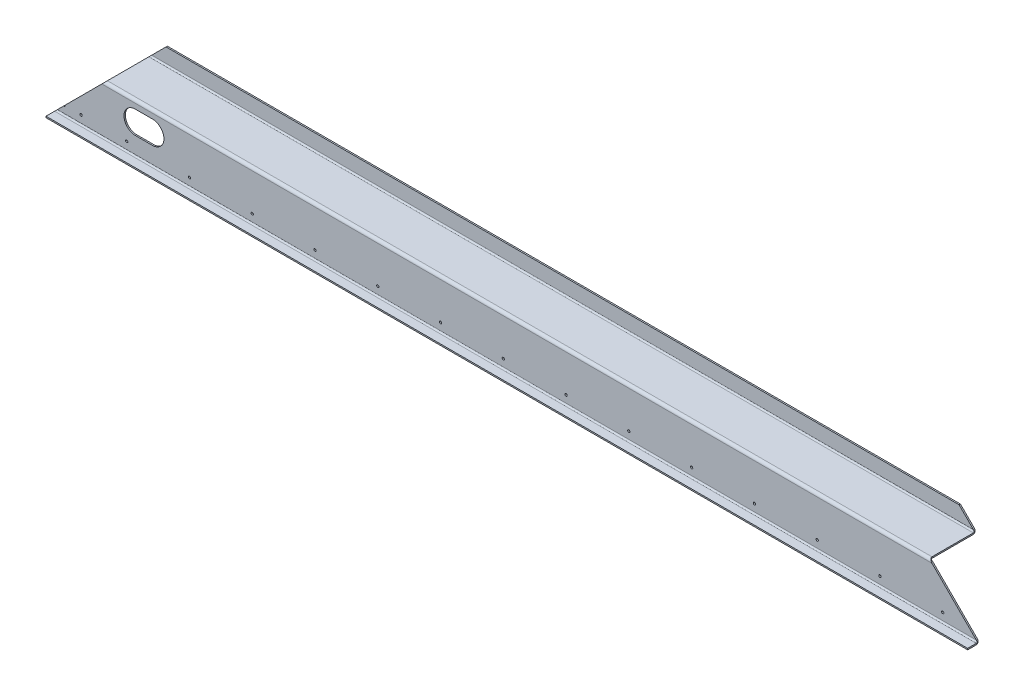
ISO-10303-21;
HEADER;
FILE_DESCRIPTION(('STEP AP214'),'2;1');
FILE_NAME('part.step','',(''),(''),'','','');
FILE_SCHEMA(('AUTOMOTIVE_DESIGN { 1 0 10303 214 1 1 1 1 }'));
ENDSEC;
DATA;
#1=APPLICATION_CONTEXT('core data for automotive mechanical design processes');
#2=APPLICATION_PROTOCOL_DEFINITION('international standard','automotive_design',2000,#1);
#3=PRODUCT_CONTEXT('',#1,'mechanical');
#4=PRODUCT('Part','Part','',(#3));
#5=PRODUCT_RELATED_PRODUCT_CATEGORY('part','',(#4));
#6=PRODUCT_DEFINITION_FORMATION('','',#4);
#7=PRODUCT_DEFINITION_CONTEXT('part definition',#1,'design');
#8=PRODUCT_DEFINITION('design','',#6,#7);
#9=PRODUCT_DEFINITION_SHAPE('','',#8);
#10=(LENGTH_UNIT() NAMED_UNIT(*) SI_UNIT(.MILLI.,.METRE.));
#11=(NAMED_UNIT(*) PLANE_ANGLE_UNIT() SI_UNIT($,.RADIAN.));
#12=(NAMED_UNIT(*) SI_UNIT($,.STERADIAN.) SOLID_ANGLE_UNIT());
#13=UNCERTAINTY_MEASURE_WITH_UNIT(LENGTH_MEASURE(1.E-05),#10,'distance_accuracy_value','');
#14=(GEOMETRIC_REPRESENTATION_CONTEXT(3) GLOBAL_UNCERTAINTY_ASSIGNED_CONTEXT((#13)) GLOBAL_UNIT_ASSIGNED_CONTEXT((#10,
#11,#12)) REPRESENTATION_CONTEXT('',''));
#15=CARTESIAN_POINT('',(0.,0.,0.));
#16=DIRECTION('',(0.,0.,1.));
#17=DIRECTION('',(1.,0.,0.));
#18=AXIS2_PLACEMENT_3D('',#15,#16,#17);
#19=CARTESIAN_POINT('',(54.0385000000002,-54.0384999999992,104.648));
#20=DIRECTION('',(-0.707106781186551,0.707106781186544,0.));
#21=DIRECTION('',(0.707106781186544,0.707106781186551,0.));
#22=AXIS2_PLACEMENT_3D('',#19,#20,#21);
#23=PLANE('',#22);
#24=DIRECTION('',(0.707106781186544,0.707106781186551,0.));
#25=VECTOR('',#24,1.);
#26=CARTESIAN_POINT('',(54.0385000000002,-54.0384999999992,101.6));
#27=LINE('',#26,#25);
#28=CARTESIAN_POINT('',(23.0423865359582,-85.0346134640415,101.6));
#29=VERTEX_POINT('',#28);
#30=CARTESIAN_POINT('',(104.901999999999,-3.17499999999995,101.6));
#31=VERTEX_POINT('',#30);
#32=EDGE_CURVE('E362',#29,#31,#27,.T.);
#33=ORIENTED_EDGE('',*,*,#32,.F.);
#34=DIRECTION('',(0.,0.,-1.));
#35=VECTOR('',#34,1.);
#36=CARTESIAN_POINT('',(23.0423865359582,-85.0346134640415,101.6));
#37=LINE('',#36,#35);
#38=CARTESIAN_POINT('',(23.0423865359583,-85.0346134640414,104.648));
#39=VERTEX_POINT('',#38);
#40=EDGE_CURVE('E578',#29,#39,#37,.F.);
#41=ORIENTED_EDGE('',*,*,#40,.T.);
#42=DIRECTION('',(0.707106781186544,0.707106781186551,0.));
#43=VECTOR('',#42,1.);
#44=CARTESIAN_POINT('',(54.0385000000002,-54.0384999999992,104.648));
#45=LINE('',#44,#43);
#46=CARTESIAN_POINT('',(104.901999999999,-3.17499999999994,104.648));
#47=VERTEX_POINT('',#46);
#48=EDGE_CURVE('E363',#39,#47,#45,.T.);
#49=ORIENTED_EDGE('',*,*,#48,.T.);
#50=DIRECTION('',(0.,0.,1.));
#51=VECTOR('',#50,1.);
#52=CARTESIAN_POINT('',(104.901999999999,-3.17499999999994,104.648));
#53=LINE('',#52,#51);
#54=EDGE_CURVE('E352',#47,#31,#53,.F.);
#55=ORIENTED_EDGE('',*,*,#54,.T.);
#56=EDGE_LOOP('',(#33,#41,#49,#55));
#57=FACE_BOUND('',#56,.T.);
#58=ADVANCED_FACE('F90',(#57),#23,.T.);
#59=CARTESIAN_POINT('',(6.22299999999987,-101.854,104.648));
#60=VERTEX_POINT('',#59);
#61=CARTESIAN_POINT('',(19.8201134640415,-88.2568865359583,104.648));
#62=VERTEX_POINT('',#61);
#63=EDGE_CURVE('E358',#60,#62,#45,.T.);
#64=ORIENTED_EDGE('',*,*,#63,.T.);
#65=DIRECTION('',(0.,0.,-1.));
#66=VECTOR('',#65,1.);
#67=CARTESIAN_POINT('',(19.8201134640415,-88.2568865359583,101.6));
#68=LINE('',#67,#66);
#69=CARTESIAN_POINT('',(19.8201134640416,-88.2568865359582,101.6));
#70=VERTEX_POINT('',#69);
#71=EDGE_CURVE('E582',#70,#62,#68,.F.);
#72=ORIENTED_EDGE('',*,*,#71,.F.);
#73=CARTESIAN_POINT('',(6.22299999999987,-101.854,101.6));
#74=VERTEX_POINT('',#73);
#75=EDGE_CURVE('E353',#74,#70,#27,.T.);
#76=ORIENTED_EDGE('',*,*,#75,.F.);
#77=DIRECTION('',(0.,0.,1.));
#78=VECTOR('',#77,1.);
#79=CARTESIAN_POINT('',(6.22299999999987,-101.854,104.648));
#80=LINE('',#79,#78);
#81=EDGE_CURVE('E348',#60,#74,#80,.F.);
#82=ORIENTED_EDGE('',*,*,#81,.F.);
#83=EDGE_LOOP('',(#64,#72,#76,#82));
#84=FACE_BOUND('',#83,.T.);
#85=ADVANCED_FACE('F662',(#84),#23,.T.);
#86=CARTESIAN_POINT('',(0.,3.60016566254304E-13,104.648));
#87=DIRECTION('',(0.,0.,-1.));
#88=DIRECTION('',(0.,1.,0.));
#89=AXIS2_PLACEMENT_3D('',#86,#87,#88);
#90=PLANE('',#89);
#91=CARTESIAN_POINT('',(58.7374999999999,-85.852,104.648));
#92=DIRECTION('',(0.,0.,1.));
#93=DIRECTION('',(1.,0.,0.));
#94=AXIS2_PLACEMENT_3D('',#91,#92,#93);
#95=CIRCLE('',#94,2.53999999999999);
#96=CARTESIAN_POINT('',(61.2774999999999,-85.852,104.648));
#97=VERTEX_POINT('',#96);
#98=EDGE_CURVE('E639',#97,#97,#95,.T.);
#99=ORIENTED_EDGE('',*,*,#98,.F.);
#100=EDGE_LOOP('',(#99));
#101=FACE_BOUND('',#100,.T.);
#102=CARTESIAN_POINT('',(217.732726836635,-39.8145,104.648));
#103=DIRECTION('',(0.,0.,-1.));
#104=DIRECTION('',(0.,1.,0.));
#105=AXIS2_PLACEMENT_3D('',#102,#103,#104);
#106=CIRCLE('',#105,25.4);
#107=CARTESIAN_POINT('',(217.732726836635,-14.4145,104.648));
#108=VERTEX_POINT('',#107);
#109=CARTESIAN_POINT('',(217.732726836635,-65.2145,104.648));
#110=VERTEX_POINT('',#109);
#111=EDGE_CURVE('E270',#108,#110,#106,.T.);
#112=ORIENTED_EDGE('',*,*,#111,.T.);
#113=DIRECTION('',(-1.,0.,0.));
#114=VECTOR('',#113,1.);
#115=CARTESIAN_POINT('',(0.,-65.2145,104.648));
#116=LINE('',#115,#114);
#117=CARTESIAN_POINT('',(179.632726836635,-65.2145,104.648));
#118=VERTEX_POINT('',#117);
#119=EDGE_CURVE('E622',#110,#118,#116,.T.);
#120=ORIENTED_EDGE('',*,*,#119,.T.);
#121=CARTESIAN_POINT('',(179.632726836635,-39.8145,104.648));
#122=DIRECTION('',(0.,0.,1.));
#123=DIRECTION('',(1.,0.,0.));
#124=AXIS2_PLACEMENT_3D('',#121,#122,#123);
#125=CIRCLE('',#124,25.4);
#126=CARTESIAN_POINT('',(179.632726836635,-14.4145,104.648));
#127=VERTEX_POINT('',#126);
#128=EDGE_CURVE('E263',#127,#118,#125,.T.);
#129=ORIENTED_EDGE('',*,*,#128,.F.);
#130=DIRECTION('',(1.,0.,0.));
#131=VECTOR('',#130,1.);
#132=CARTESIAN_POINT('',(0.,-14.4144999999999,104.648));
#133=LINE('',#132,#131);
#134=EDGE_CURVE('E107',#127,#108,#133,.T.);
#135=ORIENTED_EDGE('',*,*,#134,.T.);
#136=EDGE_LOOP('',(#112,#120,#129,#135));
#137=FACE_BOUND('',#136,.T.);
#138=CARTESIAN_POINT('',(1417.6375,-85.8519999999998,104.648));
#139=DIRECTION('',(0.,0.,-1.));
#140=DIRECTION('',(0.,1.,0.));
#141=AXIS2_PLACEMENT_3D('',#138,#139,#140);
#142=CIRCLE('',#141,2.54000000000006);
#143=CARTESIAN_POINT('',(1417.6375,-83.3119999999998,104.648));
#144=VERTEX_POINT('',#143);
#145=EDGE_CURVE('E550',#144,#144,#142,.T.);
#146=ORIENTED_EDGE('',*,*,#145,.T.);
#147=EDGE_LOOP('',(#146));
#148=FACE_BOUND('',#147,.T.);
#149=CARTESIAN_POINT('',(719.1375,-85.8519999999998,104.648));
#150=DIRECTION('',(0.,0.,-1.));
#151=DIRECTION('',(0.,1.,0.));
#152=AXIS2_PLACEMENT_3D('',#149,#150,#151);
#153=CIRCLE('',#152,2.54000000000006);
#154=CARTESIAN_POINT('',(719.1375,-83.3119999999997,104.648));
#155=VERTEX_POINT('',#154);
#156=EDGE_CURVE('E559',#155,#155,#153,.T.);
#157=ORIENTED_EDGE('',*,*,#156,.T.);
#158=EDGE_LOOP('',(#157));
#159=FACE_BOUND('',#158,.T.);
#160=CARTESIAN_POINT('',(579.4375,-85.8519999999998,104.648));
#161=DIRECTION('',(0.,0.,-1.));
#162=DIRECTION('',(0.,1.,0.));
#163=AXIS2_PLACEMENT_3D('',#160,#161,#162);
#164=CIRCLE('',#163,2.54000000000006);
#165=CARTESIAN_POINT('',(579.4375,-83.3119999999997,104.648));
#166=VERTEX_POINT('',#165);
#167=EDGE_CURVE('E567',#166,#166,#164,.T.);
#168=ORIENTED_EDGE('',*,*,#167,.T.);
#169=EDGE_LOOP('',(#168));
#170=FACE_BOUND('',#169,.T.);
#171=CARTESIAN_POINT('',(439.7375,-85.8519999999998,104.648));
#172=DIRECTION('',(0.,0.,-1.));
#173=DIRECTION('',(0.,1.,0.));
#174=AXIS2_PLACEMENT_3D('',#171,#172,#173);
#175=CIRCLE('',#174,2.54000000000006);
#176=CARTESIAN_POINT('',(439.7375,-83.3119999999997,104.648));
#177=VERTEX_POINT('',#176);
#178=EDGE_CURVE('E519',#177,#177,#175,.T.);
#179=ORIENTED_EDGE('',*,*,#178,.T.);
#180=EDGE_LOOP('',(#179));
#181=FACE_BOUND('',#180,.T.);
#182=CARTESIAN_POINT('',(300.0375,-85.8519999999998,104.648));
#183=DIRECTION('',(0.,0.,-1.));
#184=DIRECTION('',(0.,1.,0.));
#185=AXIS2_PLACEMENT_3D('',#182,#183,#184);
#186=CIRCLE('',#185,2.54000000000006);
#187=CARTESIAN_POINT('',(300.0375,-83.3119999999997,104.648));
#188=VERTEX_POINT('',#187);
#189=EDGE_CURVE('E518',#188,#188,#186,.T.);
#190=ORIENTED_EDGE('',*,*,#189,.T.);
#191=EDGE_LOOP('',(#190));
#192=FACE_BOUND('',#191,.T.);
#193=CARTESIAN_POINT('',(160.3375,-85.8519999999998,104.648));
#194=DIRECTION('',(0.,0.,-1.));
#195=DIRECTION('',(0.,1.,0.));
#196=AXIS2_PLACEMENT_3D('',#193,#194,#195);
#197=CIRCLE('',#196,2.54000000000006);
#198=CARTESIAN_POINT('',(160.3375,-83.3119999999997,104.648));
#199=VERTEX_POINT('',#198);
#200=EDGE_CURVE('E527',#199,#199,#197,.T.);
#201=ORIENTED_EDGE('',*,*,#200,.T.);
#202=EDGE_LOOP('',(#201));
#203=FACE_BOUND('',#202,.T.);
#204=CARTESIAN_POINT('',(1138.2375,-85.8519999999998,104.648));
#205=DIRECTION('',(0.,0.,-1.));
#206=DIRECTION('',(0.,1.,0.));
#207=AXIS2_PLACEMENT_3D('',#204,#205,#206);
#208=CIRCLE('',#207,2.54000000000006);
#209=CARTESIAN_POINT('',(1138.2375,-83.3119999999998,104.648));
#210=VERTEX_POINT('',#209);
#211=EDGE_CURVE('E535',#210,#210,#208,.T.);
#212=ORIENTED_EDGE('',*,*,#211,.T.);
#213=EDGE_LOOP('',(#212));
#214=FACE_BOUND('',#213,.T.);
#215=CARTESIAN_POINT('',(1277.9375,-85.8519999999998,104.648));
#216=DIRECTION('',(0.,0.,-1.));
#217=DIRECTION('',(0.,1.,0.));
#218=AXIS2_PLACEMENT_3D('',#215,#216,#217);
#219=CIRCLE('',#218,2.54000000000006);
#220=CARTESIAN_POINT('',(1277.9375,-83.3119999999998,104.648));
#221=VERTEX_POINT('',#220);
#222=EDGE_CURVE('E510',#221,#221,#219,.T.);
#223=ORIENTED_EDGE('',*,*,#222,.T.);
#224=EDGE_LOOP('',(#223));
#225=FACE_BOUND('',#224,.T.);
#226=CARTESIAN_POINT('',(1557.3375,-85.8519999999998,104.648));
#227=DIRECTION('',(0.,0.,-1.));
#228=DIRECTION('',(0.,1.,0.));
#229=AXIS2_PLACEMENT_3D('',#226,#227,#228);
#230=CIRCLE('',#229,2.54000000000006);
#231=CARTESIAN_POINT('',(1557.3375,-83.3119999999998,104.648));
#232=VERTEX_POINT('',#231);
#233=EDGE_CURVE('E551',#232,#232,#230,.T.);
#234=ORIENTED_EDGE('',*,*,#233,.T.);
#235=EDGE_LOOP('',(#234));
#236=FACE_BOUND('',#235,.T.);
#237=CARTESIAN_POINT('',(1697.0375,-85.8519999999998,104.648));
#238=DIRECTION('',(0.,0.,-1.));
#239=DIRECTION('',(0.,1.,0.));
#240=AXIS2_PLACEMENT_3D('',#237,#238,#239);
#241=CIRCLE('',#240,2.54000000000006);
#242=CARTESIAN_POINT('',(1697.0375,-83.3119999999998,104.648));
#243=VERTEX_POINT('',#242);
#244=EDGE_CURVE('E608',#243,#243,#241,.T.);
#245=ORIENTED_EDGE('',*,*,#244,.T.);
#246=EDGE_LOOP('',(#245));
#247=FACE_BOUND('',#246,.T.);
#248=CARTESIAN_POINT('',(1836.7375,-85.8519999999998,104.648));
#249=DIRECTION('',(0.,0.,-1.));
#250=DIRECTION('',(0.,1.,0.));
#251=AXIS2_PLACEMENT_3D('',#248,#249,#250);
#252=CIRCLE('',#251,2.54000000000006);
#253=CARTESIAN_POINT('',(1836.7375,-83.3119999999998,104.648));
#254=VERTEX_POINT('',#253);
#255=EDGE_CURVE('E600',#254,#254,#252,.T.);
#256=ORIENTED_EDGE('',*,*,#255,.T.);
#257=EDGE_LOOP('',(#256));
#258=FACE_BOUND('',#257,.T.);
#259=CARTESIAN_POINT('',(1976.4375,-85.8519999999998,104.648));
#260=DIRECTION('',(0.,0.,-1.));
#261=DIRECTION('',(0.,1.,0.));
#262=AXIS2_PLACEMENT_3D('',#259,#260,#261);
#263=CIRCLE('',#262,2.54000000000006);
#264=CARTESIAN_POINT('',(1976.4375,-83.3119999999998,104.648));
#265=VERTEX_POINT('',#264);
#266=EDGE_CURVE('E592',#265,#265,#263,.T.);
#267=ORIENTED_EDGE('',*,*,#266,.T.);
#268=EDGE_LOOP('',(#267));
#269=FACE_BOUND('',#268,.T.);
#270=CARTESIAN_POINT('',(20.6374999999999,-85.8519999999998,104.648));
#271=DIRECTION('',(0.,0.,-1.));
#272=DIRECTION('',(0.,1.,0.));
#273=AXIS2_PLACEMENT_3D('',#270,#271,#272);
#274=CIRCLE('',#273,2.54000000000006);
#275=EDGE_CURVE('E268',#39,#62,#274,.T.);
#276=ORIENTED_EDGE('',*,*,#275,.T.);
#277=ORIENTED_EDGE('',*,*,#63,.F.);
#278=DIRECTION('',(1.,0.,0.));
#279=VECTOR('',#278,1.);
#280=CARTESIAN_POINT('',(2057.4,-101.854,104.648));
#281=LINE('',#280,#279);
#282=CARTESIAN_POINT('',(2051.177,-101.854,104.648));
#283=VERTEX_POINT('',#282);
#284=EDGE_CURVE('E313',#283,#60,#281,.F.);
#285=ORIENTED_EDGE('',*,*,#284,.F.);
#286=DIRECTION('',(-0.707106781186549,0.707106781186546,0.));
#287=VECTOR('',#286,1.);
#288=CARTESIAN_POINT('',(974.661499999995,974.6615,104.647999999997));
#289=LINE('',#288,#287);
#290=CARTESIAN_POINT('',(1952.498,-3.17499999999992,104.648));
#291=VERTEX_POINT('',#290);
#292=EDGE_CURVE('E479',#283,#291,#289,.T.);
#293=ORIENTED_EDGE('',*,*,#292,.T.);
#294=DIRECTION('',(-1.,0.,0.));
#295=VECTOR('',#294,1.);
#296=CARTESIAN_POINT('',(2057.4,-3.175,104.648));
#297=LINE('',#296,#295);
#298=EDGE_CURVE('E301',#47,#291,#297,.F.);
#299=ORIENTED_EDGE('',*,*,#298,.F.);
#300=ORIENTED_EDGE('',*,*,#48,.F.);
#301=EDGE_LOOP('',(#276,#277,#285,#293,#299,#300));
#302=FACE_BOUND('',#301,.T.);
#303=CARTESIAN_POINT('',(858.8375,-85.8519999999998,104.648));
#304=DIRECTION('',(0.,0.,-1.));
#305=DIRECTION('',(0.,1.,0.));
#306=AXIS2_PLACEMENT_3D('',#303,#304,#305);
#307=CIRCLE('',#306,2.54000000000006);
#308=CARTESIAN_POINT('',(858.8375,-83.3119999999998,104.648));
#309=VERTEX_POINT('',#308);
#310=EDGE_CURVE('E505',#309,#309,#307,.T.);
#311=ORIENTED_EDGE('',*,*,#310,.T.);
#312=EDGE_LOOP('',(#311));
#313=FACE_BOUND('',#312,.T.);
#314=CARTESIAN_POINT('',(998.5375,-85.8519999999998,104.648));
#315=DIRECTION('',(0.,0.,1.));
#316=DIRECTION('',(1.,0.,0.));
#317=AXIS2_PLACEMENT_3D('',#314,#315,#316);
#318=CIRCLE('',#317,2.54000000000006);
#319=CARTESIAN_POINT('',(1001.0775,-85.8519999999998,104.648));
#320=VERTEX_POINT('',#319);
#321=EDGE_CURVE('E278',#320,#320,#318,.T.);
#322=ORIENTED_EDGE('',*,*,#321,.F.);
#323=EDGE_LOOP('',(#322));
#324=FACE_BOUND('',#323,.T.);
#325=ADVANCED_FACE('F653',(#101,#137,#148,#159,#170,#181,#192,#203,#214,#225,#236,#247,#258,
#269,#302,#313,#324),#90,.F.);
#326=CARTESIAN_POINT('',(0.,3.49778738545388E-13,101.6));
#327=DIRECTION('',(0.,0.,-1.));
#328=DIRECTION('',(0.,1.,0.));
#329=AXIS2_PLACEMENT_3D('',#326,#327,#328);
#330=PLANE('',#329);
#331=CARTESIAN_POINT('',(58.7374999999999,-85.852,101.6));
#332=DIRECTION('',(0.,0.,-1.));
#333=DIRECTION('',(0.,1.,0.));
#334=AXIS2_PLACEMENT_3D('',#331,#332,#333);
#335=CIRCLE('',#334,2.53999999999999);
#336=CARTESIAN_POINT('',(58.7374999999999,-83.312,101.6));
#337=VERTEX_POINT('',#336);
#338=EDGE_CURVE('E94',#337,#337,#335,.T.);
#339=ORIENTED_EDGE('',*,*,#338,.F.);
#340=EDGE_LOOP('',(#339));
#341=FACE_BOUND('',#340,.T.);
#342=DIRECTION('',(-1.,0.,0.));
#343=VECTOR('',#342,1.);
#344=CARTESIAN_POINT('',(179.632726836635,-65.2145,101.6));
#345=LINE('',#344,#343);
#346=CARTESIAN_POINT('',(217.732726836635,-65.2145,101.6));
#347=VERTEX_POINT('',#346);
#348=CARTESIAN_POINT('',(179.632726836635,-65.2145,101.6));
#349=VERTEX_POINT('',#348);
#350=EDGE_CURVE('E632',#347,#349,#345,.T.);
#351=ORIENTED_EDGE('',*,*,#350,.F.);
#352=CARTESIAN_POINT('',(217.732726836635,-39.8145,101.6));
#353=DIRECTION('',(0.,0.,-1.));
#354=DIRECTION('',(0.,1.,0.));
#355=AXIS2_PLACEMENT_3D('',#352,#353,#354);
#356=CIRCLE('',#355,25.4);
#357=CARTESIAN_POINT('',(217.732726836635,-14.4145,101.6));
#358=VERTEX_POINT('',#357);
#359=EDGE_CURVE('E258',#358,#347,#356,.T.);
#360=ORIENTED_EDGE('',*,*,#359,.F.);
#361=DIRECTION('',(1.,0.,0.));
#362=VECTOR('',#361,1.);
#363=CARTESIAN_POINT('',(179.632726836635,-14.4145,101.6));
#364=LINE('',#363,#362);
#365=CARTESIAN_POINT('',(179.632726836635,-14.4145,101.6));
#366=VERTEX_POINT('',#365);
#367=EDGE_CURVE('E242',#366,#358,#364,.T.);
#368=ORIENTED_EDGE('',*,*,#367,.F.);
#369=CARTESIAN_POINT('',(179.632726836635,-39.8145,101.6));
#370=DIRECTION('',(0.,0.,-1.));
#371=DIRECTION('',(0.,1.,0.));
#372=AXIS2_PLACEMENT_3D('',#369,#370,#371);
#373=CIRCLE('',#372,25.4);
#374=EDGE_CURVE('E256',#349,#366,#373,.T.);
#375=ORIENTED_EDGE('',*,*,#374,.F.);
#376=EDGE_LOOP('',(#351,#360,#368,#375));
#377=FACE_BOUND('',#376,.T.);
#378=CARTESIAN_POINT('',(1417.6375,-85.8519999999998,101.6));
#379=DIRECTION('',(0.,0.,-1.));
#380=DIRECTION('',(0.,1.,0.));
#381=AXIS2_PLACEMENT_3D('',#378,#379,#380);
#382=CIRCLE('',#381,2.54000000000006);
#383=CARTESIAN_POINT('',(1417.6375,-83.3119999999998,101.6));
#384=VERTEX_POINT('',#383);
#385=EDGE_CURVE('E546',#384,#384,#382,.T.);
#386=ORIENTED_EDGE('',*,*,#385,.F.);
#387=EDGE_LOOP('',(#386));
#388=FACE_BOUND('',#387,.T.);
#389=CARTESIAN_POINT('',(719.1375,-85.8519999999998,101.6));
#390=DIRECTION('',(0.,0.,-1.));
#391=DIRECTION('',(0.,1.,0.));
#392=AXIS2_PLACEMENT_3D('',#389,#390,#391);
#393=CIRCLE('',#392,2.54000000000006);
#394=CARTESIAN_POINT('',(719.1375,-83.3119999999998,101.6));
#395=VERTEX_POINT('',#394);
#396=EDGE_CURVE('E555',#395,#395,#393,.T.);
#397=ORIENTED_EDGE('',*,*,#396,.F.);
#398=EDGE_LOOP('',(#397));
#399=FACE_BOUND('',#398,.T.);
#400=CARTESIAN_POINT('',(579.4375,-85.8519999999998,101.6));
#401=DIRECTION('',(0.,0.,-1.));
#402=DIRECTION('',(0.,1.,0.));
#403=AXIS2_PLACEMENT_3D('',#400,#401,#402);
#404=CIRCLE('',#403,2.54000000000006);
#405=CARTESIAN_POINT('',(579.4375,-83.3119999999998,101.6));
#406=VERTEX_POINT('',#405);
#407=EDGE_CURVE('E563',#406,#406,#404,.T.);
#408=ORIENTED_EDGE('',*,*,#407,.F.);
#409=EDGE_LOOP('',(#408));
#410=FACE_BOUND('',#409,.T.);
#411=CARTESIAN_POINT('',(439.7375,-85.8519999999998,101.6));
#412=DIRECTION('',(0.,0.,-1.));
#413=DIRECTION('',(0.,1.,0.));
#414=AXIS2_PLACEMENT_3D('',#411,#412,#413);
#415=CIRCLE('',#414,2.54000000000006);
#416=CARTESIAN_POINT('',(439.7375,-83.3119999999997,101.6));
#417=VERTEX_POINT('',#416);
#418=EDGE_CURVE('E571',#417,#417,#415,.T.);
#419=ORIENTED_EDGE('',*,*,#418,.F.);
#420=EDGE_LOOP('',(#419));
#421=FACE_BOUND('',#420,.T.);
#422=CARTESIAN_POINT('',(300.0375,-85.8519999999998,101.6));
#423=DIRECTION('',(0.,0.,-1.));
#424=DIRECTION('',(0.,1.,0.));
#425=AXIS2_PLACEMENT_3D('',#422,#423,#424);
#426=CIRCLE('',#425,2.54000000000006);
#427=CARTESIAN_POINT('',(300.0375,-83.3119999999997,101.6));
#428=VERTEX_POINT('',#427);
#429=EDGE_CURVE('E514',#428,#428,#426,.T.);
#430=ORIENTED_EDGE('',*,*,#429,.F.);
#431=EDGE_LOOP('',(#430));
#432=FACE_BOUND('',#431,.T.);
#433=CARTESIAN_POINT('',(160.3375,-85.8519999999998,101.6));
#434=DIRECTION('',(0.,0.,-1.));
#435=DIRECTION('',(0.,1.,0.));
#436=AXIS2_PLACEMENT_3D('',#433,#434,#435);
#437=CIRCLE('',#436,2.54000000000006);
#438=CARTESIAN_POINT('',(160.3375,-83.3119999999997,101.6));
#439=VERTEX_POINT('',#438);
#440=EDGE_CURVE('E523',#439,#439,#437,.T.);
#441=ORIENTED_EDGE('',*,*,#440,.F.);
#442=EDGE_LOOP('',(#441));
#443=FACE_BOUND('',#442,.T.);
#444=CARTESIAN_POINT('',(1138.2375,-85.8519999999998,101.6));
#445=DIRECTION('',(0.,0.,-1.));
#446=DIRECTION('',(0.,1.,0.));
#447=AXIS2_PLACEMENT_3D('',#444,#445,#446);
#448=CIRCLE('',#447,2.54000000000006);
#449=CARTESIAN_POINT('',(1138.2375,-83.3119999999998,101.6));
#450=VERTEX_POINT('',#449);
#451=EDGE_CURVE('E531',#450,#450,#448,.T.);
#452=ORIENTED_EDGE('',*,*,#451,.F.);
#453=EDGE_LOOP('',(#452));
#454=FACE_BOUND('',#453,.T.);
#455=CARTESIAN_POINT('',(1277.9375,-85.8519999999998,101.6));
#456=DIRECTION('',(0.,0.,-1.));
#457=DIRECTION('',(0.,1.,0.));
#458=AXIS2_PLACEMENT_3D('',#455,#456,#457);
#459=CIRCLE('',#458,2.54000000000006);
#460=CARTESIAN_POINT('',(1277.9375,-83.3119999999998,101.6));
#461=VERTEX_POINT('',#460);
#462=EDGE_CURVE('E539',#461,#461,#459,.T.);
#463=ORIENTED_EDGE('',*,*,#462,.F.);
#464=EDGE_LOOP('',(#463));
#465=FACE_BOUND('',#464,.T.);
#466=CARTESIAN_POINT('',(1557.3375,-85.8519999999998,101.6));
#467=DIRECTION('',(0.,0.,-1.));
#468=DIRECTION('',(0.,1.,0.));
#469=AXIS2_PLACEMENT_3D('',#466,#467,#468);
#470=CIRCLE('',#469,2.54000000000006);
#471=CARTESIAN_POINT('',(1557.3375,-83.3119999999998,101.6));
#472=VERTEX_POINT('',#471);
#473=EDGE_CURVE('E612',#472,#472,#470,.T.);
#474=ORIENTED_EDGE('',*,*,#473,.F.);
#475=EDGE_LOOP('',(#474));
#476=FACE_BOUND('',#475,.T.);
#477=CARTESIAN_POINT('',(1697.0375,-85.8519999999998,101.6));
#478=DIRECTION('',(0.,0.,-1.));
#479=DIRECTION('',(0.,1.,0.));
#480=AXIS2_PLACEMENT_3D('',#477,#478,#479);
#481=CIRCLE('',#480,2.54000000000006);
#482=CARTESIAN_POINT('',(1697.0375,-83.3119999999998,101.6));
#483=VERTEX_POINT('',#482);
#484=EDGE_CURVE('E604',#483,#483,#481,.T.);
#485=ORIENTED_EDGE('',*,*,#484,.F.);
#486=EDGE_LOOP('',(#485));
#487=FACE_BOUND('',#486,.T.);
#488=CARTESIAN_POINT('',(1836.7375,-85.8519999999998,101.6));
#489=DIRECTION('',(0.,0.,-1.));
#490=DIRECTION('',(0.,1.,0.));
#491=AXIS2_PLACEMENT_3D('',#488,#489,#490);
#492=CIRCLE('',#491,2.54000000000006);
#493=CARTESIAN_POINT('',(1836.7375,-83.3119999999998,101.6));
#494=VERTEX_POINT('',#493);
#495=EDGE_CURVE('E596',#494,#494,#492,.T.);
#496=ORIENTED_EDGE('',*,*,#495,.F.);
#497=EDGE_LOOP('',(#496));
#498=FACE_BOUND('',#497,.T.);
#499=CARTESIAN_POINT('',(1976.4375,-85.8519999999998,101.6));
#500=DIRECTION('',(0.,0.,-1.));
#501=DIRECTION('',(0.,1.,0.));
#502=AXIS2_PLACEMENT_3D('',#499,#500,#501);
#503=CIRCLE('',#502,2.54000000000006);
#504=CARTESIAN_POINT('',(1976.4375,-83.3119999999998,101.6));
#505=VERTEX_POINT('',#504);
#506=EDGE_CURVE('E584',#505,#505,#503,.T.);
#507=ORIENTED_EDGE('',*,*,#506,.F.);
#508=EDGE_LOOP('',(#507));
#509=FACE_BOUND('',#508,.T.);
#510=CARTESIAN_POINT('',(858.8375,-85.8519999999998,101.6));
#511=DIRECTION('',(0.,0.,-1.));
#512=DIRECTION('',(0.,1.,0.));
#513=AXIS2_PLACEMENT_3D('',#510,#511,#512);
#514=CIRCLE('',#513,2.54000000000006);
#515=CARTESIAN_POINT('',(858.8375,-83.3119999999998,101.6));
#516=VERTEX_POINT('',#515);
#517=EDGE_CURVE('E506',#516,#516,#514,.T.);
#518=ORIENTED_EDGE('',*,*,#517,.F.);
#519=EDGE_LOOP('',(#518));
#520=FACE_BOUND('',#519,.T.);
#521=CARTESIAN_POINT('',(998.5375,-85.8519999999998,101.6));
#522=DIRECTION('',(0.,0.,-1.));
#523=DIRECTION('',(0.,1.,0.));
#524=AXIS2_PLACEMENT_3D('',#521,#522,#523);
#525=CIRCLE('',#524,2.54000000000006);
#526=CARTESIAN_POINT('',(998.5375,-83.3119999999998,101.6));
#527=VERTEX_POINT('',#526);
#528=EDGE_CURVE('E273',#527,#527,#525,.T.);
#529=ORIENTED_EDGE('',*,*,#528,.F.);
#530=EDGE_LOOP('',(#529));
#531=FACE_BOUND('',#530,.T.);
#532=ORIENTED_EDGE('',*,*,#75,.T.);
#533=CARTESIAN_POINT('',(20.6374999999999,-85.8519999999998,101.6));
#534=DIRECTION('',(0.,0.,-1.));
#535=DIRECTION('',(0.,1.,0.));
#536=AXIS2_PLACEMENT_3D('',#533,#534,#535);
#537=CIRCLE('',#536,2.54000000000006);
#538=EDGE_CURVE('E115',#29,#70,#537,.T.);
#539=ORIENTED_EDGE('',*,*,#538,.F.);
#540=ORIENTED_EDGE('',*,*,#32,.T.);
#541=DIRECTION('',(-1.,0.,0.));
#542=VECTOR('',#541,1.);
#543=CARTESIAN_POINT('',(2057.4,-3.175,101.6));
#544=LINE('',#543,#542);
#545=CARTESIAN_POINT('',(1952.498,-3.17499999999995,101.6));
#546=VERTEX_POINT('',#545);
#547=EDGE_CURVE('E305',#546,#31,#544,.T.);
#548=ORIENTED_EDGE('',*,*,#547,.F.);
#549=DIRECTION('',(-0.707106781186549,0.707106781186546,0.));
#550=VECTOR('',#549,1.);
#551=CARTESIAN_POINT('',(974.661499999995,974.6615,101.599999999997));
#552=LINE('',#551,#550);
#553=CARTESIAN_POINT('',(2051.177,-101.854,101.6));
#554=VERTEX_POINT('',#553);
#555=EDGE_CURVE('E469',#554,#546,#552,.T.);
#556=ORIENTED_EDGE('',*,*,#555,.F.);
#557=DIRECTION('',(1.,0.,0.));
#558=VECTOR('',#557,1.);
#559=CARTESIAN_POINT('',(2057.4,-101.854,101.6));
#560=LINE('',#559,#558);
#561=EDGE_CURVE('E309',#554,#74,#560,.F.);
#562=ORIENTED_EDGE('',*,*,#561,.T.);
#563=EDGE_LOOP('',(#532,#539,#540,#548,#556,#562));
#564=FACE_BOUND('',#563,.T.);
#565=ADVANCED_FACE('F254',(#341,#377,#388,#399,#410,#421,#432,#443,#454,#465,#476,#487,#498,
#509,#520,#531,#564),#330,.T.);
#566=CARTESIAN_POINT('',(2168.76792134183,3.048,0.));
#567=DIRECTION('',(0.,-1.,0.));
#568=DIRECTION('',(0.,0.,-1.));
#569=AXIS2_PLACEMENT_3D('',#566,#567,#568);
#570=PLANE('',#569);
#571=DIRECTION('',(0.,0.,-1.));
#572=VECTOR('',#571,1.);
#573=CARTESIAN_POINT('',(1946.275,3.048,0.));
#574=LINE('',#573,#572);
#575=CARTESIAN_POINT('',(1946.275,3.04800000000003,98.425));
#576=VERTEX_POINT('',#575);
#577=CARTESIAN_POINT('',(1946.275,3.048,6.223));
#578=VERTEX_POINT('',#577);
#579=EDGE_CURVE('E430',#576,#578,#574,.T.);
#580=ORIENTED_EDGE('',*,*,#579,.T.);
#581=DIRECTION('',(-1.,0.,0.));
#582=VECTOR('',#581,1.);
#583=CARTESIAN_POINT('',(2168.76792134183,3.048,6.223));
#584=LINE('',#583,#582);
#585=CARTESIAN_POINT('',(111.124999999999,3.048,6.223));
#586=VERTEX_POINT('',#585);
#587=EDGE_CURVE('E293',#578,#586,#584,.T.);
#588=ORIENTED_EDGE('',*,*,#587,.T.);
#589=DIRECTION('',(0.,0.,-1.));
#590=VECTOR('',#589,1.);
#591=CARTESIAN_POINT('',(111.124999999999,3.048,-2.72468010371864E-13));
#592=LINE('',#591,#590);
#593=CARTESIAN_POINT('',(111.124999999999,3.04800000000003,98.425));
#594=VERTEX_POINT('',#593);
#595=EDGE_CURVE('E357',#594,#586,#592,.T.);
#596=ORIENTED_EDGE('',*,*,#595,.F.);
#597=DIRECTION('',(-1.,0.,0.));
#598=VECTOR('',#597,1.);
#599=CARTESIAN_POINT('',(0.,3.04800000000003,98.425));
#600=LINE('',#599,#598);
#601=EDGE_CURVE('E296',#594,#576,#600,.F.);
#602=ORIENTED_EDGE('',*,*,#601,.T.);
#603=EDGE_LOOP('',(#580,#588,#596,#602));
#604=FACE_BOUND('',#603,.T.);
#605=ADVANCED_FACE('F92',(#604),#570,.F.);
#606=CARTESIAN_POINT('',(2168.76792134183,0.,0.));
#607=DIRECTION('',(0.,-1.,0.));
#608=DIRECTION('',(0.,0.,-1.));
#609=AXIS2_PLACEMENT_3D('',#606,#607,#608);
#610=PLANE('',#609);
#611=DIRECTION('',(-1.,0.,0.));
#612=VECTOR('',#611,1.);
#613=CARTESIAN_POINT('',(2168.76792134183,0.,6.223));
#614=LINE('',#613,#612);
#615=CARTESIAN_POINT('',(1946.275,0.,6.223));
#616=VERTEX_POINT('',#615);
#617=CARTESIAN_POINT('',(111.124999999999,0.,6.223));
#618=VERTEX_POINT('',#617);
#619=EDGE_CURVE('E249',#616,#618,#614,.T.);
#620=ORIENTED_EDGE('',*,*,#619,.F.);
#621=DIRECTION('',(0.,0.,-1.));
#622=VECTOR('',#621,1.);
#623=CARTESIAN_POINT('',(1946.275,0.,0.));
#624=LINE('',#623,#622);
#625=CARTESIAN_POINT('',(1946.275,0.,98.425));
#626=VERTEX_POINT('',#625);
#627=EDGE_CURVE('E426',#626,#616,#624,.T.);
#628=ORIENTED_EDGE('',*,*,#627,.F.);
#629=DIRECTION('',(-1.,0.,0.));
#630=VECTOR('',#629,1.);
#631=CARTESIAN_POINT('',(0.,0.,98.425));
#632=LINE('',#631,#630);
#633=CARTESIAN_POINT('',(111.124999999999,0.,98.425));
#634=VERTEX_POINT('',#633);
#635=EDGE_CURVE('E297',#634,#626,#632,.F.);
#636=ORIENTED_EDGE('',*,*,#635,.F.);
#637=DIRECTION('',(0.,0.,-1.));
#638=VECTOR('',#637,1.);
#639=CARTESIAN_POINT('',(111.124999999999,0.,0.));
#640=LINE('',#639,#638);
#641=EDGE_CURVE('E371',#634,#618,#640,.T.);
#642=ORIENTED_EDGE('',*,*,#641,.T.);
#643=EDGE_LOOP('',(#620,#628,#636,#642));
#644=FACE_BOUND('',#643,.T.);
#645=ADVANCED_FACE('F660',(#644),#610,.T.);
#646=CARTESIAN_POINT('',(2168.76792134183,6.223,6.223));
#647=DIRECTION('',(-1.,0.,0.));
#648=DIRECTION('',(0.,0.,1.));
#649=AXIS2_PLACEMENT_3D('',#646,#647,#648);
#650=CYLINDRICAL_SURFACE('',#649,6.223);
#651=DIRECTION('',(-1.,0.,0.));
#652=VECTOR('',#651,1.);
#653=CARTESIAN_POINT('',(2168.76792134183,6.22299999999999,0.));
#654=LINE('',#653,#652);
#655=CARTESIAN_POINT('',(1943.1,6.22299999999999,0.));
#656=VERTEX_POINT('',#655);
#657=CARTESIAN_POINT('',(114.299999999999,6.22299999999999,0.));
#658=VERTEX_POINT('',#657);
#659=EDGE_CURVE('E281',#656,#658,#654,.T.);
#660=ORIENTED_EDGE('',*,*,#659,.F.);
#661=CARTESIAN_POINT('',(1943.1,6.223,6.223));
#662=DIRECTION('',(-0.890761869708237,-0.454470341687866,0.));
#663=DIRECTION('',(-0.454470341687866,0.890761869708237,0.));
#664=AXIS2_PLACEMENT_3D('',#661,#662,#663);
#665=ELLIPSE('',#664,6.9861544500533,6.223);
#666=EDGE_CURVE('E451',#616,#656,#665,.F.);
#667=ORIENTED_EDGE('',*,*,#666,.F.);
#668=ORIENTED_EDGE('',*,*,#619,.T.);
#669=CARTESIAN_POINT('',(114.299999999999,6.223,6.223));
#670=DIRECTION('',(-0.890761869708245,0.454470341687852,0.));
#671=DIRECTION('',(-0.454470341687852,-0.890761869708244,0.));
#672=AXIS2_PLACEMENT_3D('',#669,#670,#671);
#673=ELLIPSE('',#672,6.98615445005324,6.223);
#674=EDGE_CURVE('E385',#618,#658,#673,.F.);
#675=ORIENTED_EDGE('',*,*,#674,.T.);
#676=EDGE_LOOP('',(#660,#667,#668,#675));
#677=FACE_BOUND('',#676,.T.);
#678=ADVANCED_FACE('F757',(#677),#650,.T.);
#679=CARTESIAN_POINT('',(2168.76792134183,0.,0.));
#680=DIRECTION('',(0.,0.,-1.));
#681=DIRECTION('',(-1.,0.,0.));
#682=AXIS2_PLACEMENT_3D('',#679,#680,#681);
#683=PLANE('',#682);
#684=DIRECTION('',(-1.,0.,0.));
#685=VECTOR('',#684,1.);
#686=CARTESIAN_POINT('',(2168.76792134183,38.1,0.));
#687=LINE('',#686,#685);
#688=CARTESIAN_POINT('',(1911.223,38.1,0.));
#689=VERTEX_POINT('',#688);
#690=CARTESIAN_POINT('',(146.176999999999,38.1000000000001,0.));
#691=VERTEX_POINT('',#690);
#692=EDGE_CURVE('E284',#689,#691,#687,.T.);
#693=ORIENTED_EDGE('',*,*,#692,.F.);
#694=DIRECTION('',(-0.707106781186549,0.707106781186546,0.));
#695=VECTOR('',#694,1.);
#696=CARTESIAN_POINT('',(2059.04546067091,-109.722460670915,0.));
#697=LINE('',#696,#695);
#698=EDGE_CURVE('E442',#656,#689,#697,.T.);
#699=ORIENTED_EDGE('',*,*,#698,.F.);
#700=ORIENTED_EDGE('',*,*,#659,.T.);
#701=DIRECTION('',(0.707106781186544,0.707106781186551,0.));
#702=VECTOR('',#701,1.);
#703=CARTESIAN_POINT('',(1138.4224606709,1030.34546067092,0.));
#704=LINE('',#703,#702);
#705=EDGE_CURVE('E340',#658,#691,#704,.T.);
#706=ORIENTED_EDGE('',*,*,#705,.T.);
#707=EDGE_LOOP('',(#693,#699,#700,#706));
#708=FACE_BOUND('',#707,.T.);
#709=ADVANCED_FACE('F947',(#708),#683,.T.);
#710=CARTESIAN_POINT('',(2168.76792134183,38.1,3.048));
#711=DIRECTION('',(0.,1.,0.));
#712=DIRECTION('',(0.,0.,1.));
#713=AXIS2_PLACEMENT_3D('',#710,#711,#712);
#714=PLANE('',#713);
#715=DIRECTION('',(-1.,0.,0.));
#716=VECTOR('',#715,1.);
#717=CARTESIAN_POINT('',(2168.76792134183,38.1,3.048));
#718=LINE('',#717,#716);
#719=CARTESIAN_POINT('',(1911.223,38.1,3.04800000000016));
#720=VERTEX_POINT('',#719);
#721=CARTESIAN_POINT('',(146.176999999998,38.1000000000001,3.048));
#722=VERTEX_POINT('',#721);
#723=EDGE_CURVE('E287',#720,#722,#718,.T.);
#724=ORIENTED_EDGE('',*,*,#723,.F.);
#725=DIRECTION('',(0.,0.,1.));
#726=VECTOR('',#725,1.);
#727=CARTESIAN_POINT('',(1911.223,38.1,3.04800000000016));
#728=LINE('',#727,#726);
#729=EDGE_CURVE('E441',#720,#689,#728,.F.);
#730=ORIENTED_EDGE('',*,*,#729,.T.);
#731=ORIENTED_EDGE('',*,*,#692,.T.);
#732=DIRECTION('',(0.,0.,-1.));
#733=VECTOR('',#732,1.);
#734=CARTESIAN_POINT('',(146.176999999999,38.1000000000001,0.));
#735=LINE('',#734,#733);
#736=EDGE_CURVE('E324',#691,#722,#735,.F.);
#737=ORIENTED_EDGE('',*,*,#736,.T.);
#738=EDGE_LOOP('',(#724,#730,#731,#737));
#739=FACE_BOUND('',#738,.T.);
#740=ADVANCED_FACE('F943',(#739),#714,.T.);
#741=CARTESIAN_POINT('',(2168.76792134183,0.,3.048));
#742=DIRECTION('',(0.,0.,-1.));
#743=DIRECTION('',(-1.,0.,0.));
#744=AXIS2_PLACEMENT_3D('',#741,#742,#743);
#745=PLANE('',#744);
#746=DIRECTION('',(-0.707106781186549,0.707106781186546,0.));
#747=VECTOR('',#746,1.);
#748=CARTESIAN_POINT('',(2059.04546067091,-109.722460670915,3.048));
#749=LINE('',#748,#747);
#750=CARTESIAN_POINT('',(1943.1,6.22299999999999,3.048));
#751=VERTEX_POINT('',#750);
#752=EDGE_CURVE('E447',#751,#720,#749,.T.);
#753=ORIENTED_EDGE('',*,*,#752,.T.);
#754=ORIENTED_EDGE('',*,*,#723,.T.);
#755=DIRECTION('',(0.707106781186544,0.707106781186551,0.));
#756=VECTOR('',#755,1.);
#757=CARTESIAN_POINT('',(1138.4224606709,1030.34546067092,3.048));
#758=LINE('',#757,#756);
#759=CARTESIAN_POINT('',(114.299999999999,6.22299999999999,3.048));
#760=VERTEX_POINT('',#759);
#761=EDGE_CURVE('E336',#760,#722,#758,.T.);
#762=ORIENTED_EDGE('',*,*,#761,.F.);
#763=DIRECTION('',(-1.,0.,0.));
#764=VECTOR('',#763,1.);
#765=CARTESIAN_POINT('',(2168.76792134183,6.22299999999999,3.048));
#766=LINE('',#765,#764);
#767=EDGE_CURVE('E290',#751,#760,#766,.T.);
#768=ORIENTED_EDGE('',*,*,#767,.F.);
#769=EDGE_LOOP('',(#753,#754,#762,#768));
#770=FACE_BOUND('',#769,.T.);
#771=ADVANCED_FACE('F941',(#770),#745,.F.);
#772=CARTESIAN_POINT('',(2168.76792134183,6.223,6.223));
#773=DIRECTION('',(-1.,0.,0.));
#774=DIRECTION('',(0.,0.,1.));
#775=AXIS2_PLACEMENT_3D('',#772,#773,#774);
#776=CYLINDRICAL_SURFACE('',#775,3.175);
#777=CARTESIAN_POINT('',(1943.1,6.223,6.223));
#778=DIRECTION('',(-0.707106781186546,-0.707106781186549,0.));
#779=DIRECTION('',(-0.707106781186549,0.707106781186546,0.));
#780=AXIS2_PLACEMENT_3D('',#777,#778,#779);
#781=ELLIPSE('',#780,4.49012806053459,3.175);
#782=EDGE_CURVE('E454',#578,#751,#781,.F.);
#783=ORIENTED_EDGE('',*,*,#782,.T.);
#784=ORIENTED_EDGE('',*,*,#767,.T.);
#785=CARTESIAN_POINT('',(114.299999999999,6.223,6.223));
#786=DIRECTION('',(-0.707106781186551,0.707106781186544,0.));
#787=DIRECTION('',(-0.707106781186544,-0.707106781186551,0.));
#788=AXIS2_PLACEMENT_3D('',#785,#786,#787);
#789=ELLIPSE('',#788,4.49012806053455,3.175);
#790=EDGE_CURVE('E381',#586,#760,#789,.F.);
#791=ORIENTED_EDGE('',*,*,#790,.F.);
#792=ORIENTED_EDGE('',*,*,#587,.F.);
#793=EDGE_LOOP('',(#783,#784,#791,#792));
#794=FACE_BOUND('',#793,.T.);
#795=ADVANCED_FACE('F1392',(#794),#776,.F.);
#796=CARTESIAN_POINT('',(0.,-3.17499999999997,98.425));
#797=DIRECTION('',(-1.,0.,0.));
#798=DIRECTION('',(0.,0.,1.));
#799=AXIS2_PLACEMENT_3D('',#796,#797,#798);
#800=CYLINDRICAL_SURFACE('',#799,6.223);
#801=ORIENTED_EDGE('',*,*,#298,.T.);
#802=CARTESIAN_POINT('',(1952.498,-3.17499999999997,98.425));
#803=DIRECTION('',(-0.707106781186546,-0.707106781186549,0.));
#804=DIRECTION('',(-0.707106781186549,0.707106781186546,0.));
#805=AXIS2_PLACEMENT_3D('',#802,#803,#804);
#806=ELLIPSE('',#805,8.80065099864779,6.223);
#807=EDGE_CURVE('E495',#576,#291,#806,.F.);
#808=ORIENTED_EDGE('',*,*,#807,.F.);
#809=ORIENTED_EDGE('',*,*,#601,.F.);
#810=CARTESIAN_POINT('',(104.901999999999,-3.17499999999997,98.425));
#811=DIRECTION('',(-0.707106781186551,0.707106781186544,0.));
#812=DIRECTION('',(-0.707106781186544,-0.707106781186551,0.));
#813=AXIS2_PLACEMENT_3D('',#810,#811,#812);
#814=ELLIPSE('',#813,8.80065099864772,6.223);
#815=EDGE_CURVE('E415',#594,#47,#814,.F.);
#816=ORIENTED_EDGE('',*,*,#815,.T.);
#817=EDGE_LOOP('',(#801,#808,#809,#816));
#818=FACE_BOUND('',#817,.T.);
#819=ADVANCED_FACE('F769',(#818),#800,.T.);
#820=CARTESIAN_POINT('',(0.,-3.17499999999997,98.425));
#821=DIRECTION('',(-1.,0.,0.));
#822=DIRECTION('',(0.,0.,1.));
#823=AXIS2_PLACEMENT_3D('',#820,#821,#822);
#824=CYLINDRICAL_SURFACE('',#823,3.175);
#825=CARTESIAN_POINT('',(1952.498,-3.17499999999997,98.425));
#826=DIRECTION('',(-0.454470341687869,-0.890761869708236,0.));
#827=DIRECTION('',(-0.890761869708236,0.454470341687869,0.));
#828=AXIS2_PLACEMENT_3D('',#825,#826,#827);
#829=ELLIPSE('',#828,6.98615445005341,3.175);
#830=EDGE_CURVE('E458',#626,#546,#829,.F.);
#831=ORIENTED_EDGE('',*,*,#830,.T.);
#832=ORIENTED_EDGE('',*,*,#547,.T.);
#833=CARTESIAN_POINT('',(104.901999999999,-3.17499999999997,98.425));
#834=DIRECTION('',(-0.454470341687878,0.890761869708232,0.));
#835=DIRECTION('',(-0.890761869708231,-0.454470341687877,0.));
#836=AXIS2_PLACEMENT_3D('',#833,#834,#835);
#837=ELLIPSE('',#836,6.98615445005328,3.175);
#838=EDGE_CURVE('E386',#634,#31,#837,.F.);
#839=ORIENTED_EDGE('',*,*,#838,.F.);
#840=ORIENTED_EDGE('',*,*,#635,.T.);
#841=EDGE_LOOP('',(#831,#832,#839,#840));
#842=FACE_BOUND('',#841,.T.);
#843=ADVANCED_FACE('F699',(#842),#824,.F.);
#844=CARTESIAN_POINT('',(2057.4,-101.854,107.823));
#845=DIRECTION('',(1.,0.,0.));
#846=DIRECTION('',(0.,-1.,0.));
#847=AXIS2_PLACEMENT_3D('',#844,#845,#846);
#848=CYLINDRICAL_SURFACE('',#847,6.223);
#849=ORIENTED_EDGE('',*,*,#561,.F.);
#850=CARTESIAN_POINT('',(2051.177,-101.854,107.823));
#851=DIRECTION('',(-0.890761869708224,-0.454470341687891,0.));
#852=DIRECTION('',(0.454470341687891,-0.890761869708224,0.));
#853=AXIS2_PLACEMENT_3D('',#850,#851,#852);
#854=ELLIPSE('',#853,6.9861544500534,6.223);
#855=CARTESIAN_POINT('',(2054.352,-108.077,107.823));
#856=VERTEX_POINT('',#855);
#857=EDGE_CURVE('E491',#856,#554,#854,.F.);
#858=ORIENTED_EDGE('',*,*,#857,.F.);
#859=DIRECTION('',(1.,0.,0.));
#860=VECTOR('',#859,1.);
#861=CARTESIAN_POINT('',(1.11022302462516E-13,-108.077,107.823));
#862=LINE('',#861,#860);
#863=CARTESIAN_POINT('',(3.04799999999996,-108.077,107.823));
#864=VERTEX_POINT('',#863);
#865=EDGE_CURVE('E323',#856,#864,#862,.F.);
#866=ORIENTED_EDGE('',*,*,#865,.T.);
#867=CARTESIAN_POINT('',(6.22299999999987,-101.854,107.823));
#868=DIRECTION('',(-0.890761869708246,0.45447034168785,0.));
#869=DIRECTION('',(0.45447034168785,0.890761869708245,0.));
#870=AXIS2_PLACEMENT_3D('',#867,#868,#869);
#871=ELLIPSE('',#870,6.98615445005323,6.223);
#872=EDGE_CURVE('E410',#864,#74,#871,.F.);
#873=ORIENTED_EDGE('',*,*,#872,.T.);
#874=EDGE_LOOP('',(#849,#858,#866,#873));
#875=FACE_BOUND('',#874,.T.);
#876=ADVANCED_FACE('F696',(#875),#848,.T.);
#877=CARTESIAN_POINT('',(2057.4,-101.854,107.823));
#878=DIRECTION('',(1.,0.,0.));
#879=DIRECTION('',(0.,-1.,0.));
#880=AXIS2_PLACEMENT_3D('',#877,#878,#879);
#881=CYLINDRICAL_SURFACE('',#880,3.175);
#882=CARTESIAN_POINT('',(2051.177,-101.854,107.823));
#883=DIRECTION('',(-0.707106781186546,-0.707106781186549,0.));
#884=DIRECTION('',(0.707106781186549,-0.707106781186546,0.));
#885=AXIS2_PLACEMENT_3D('',#882,#883,#884);
#886=ELLIPSE('',#885,4.49012806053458,3.175);
#887=CARTESIAN_POINT('',(2054.352,-105.029,107.823));
#888=VERTEX_POINT('',#887);
#889=EDGE_CURVE('E277',#888,#283,#886,.F.);
#890=ORIENTED_EDGE('',*,*,#889,.T.);
#891=ORIENTED_EDGE('',*,*,#284,.T.);
#892=CARTESIAN_POINT('',(6.22299999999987,-101.854,107.823));
#893=DIRECTION('',(-0.707106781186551,0.707106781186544,0.));
#894=DIRECTION('',(0.707106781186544,0.707106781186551,0.));
#895=AXIS2_PLACEMENT_3D('',#892,#893,#894);
#896=ELLIPSE('',#895,4.49012806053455,3.175);
#897=CARTESIAN_POINT('',(3.04799999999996,-105.029,107.823));
#898=VERTEX_POINT('',#897);
#899=EDGE_CURVE('E406',#898,#60,#896,.F.);
#900=ORIENTED_EDGE('',*,*,#899,.F.);
#901=DIRECTION('',(1.,0.,0.));
#902=VECTOR('',#901,1.);
#903=CARTESIAN_POINT('',(1.11022302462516E-13,-105.029,107.823));
#904=LINE('',#903,#902);
#905=EDGE_CURVE('E319',#898,#888,#904,.T.);
#906=ORIENTED_EDGE('',*,*,#905,.T.);
#907=EDGE_LOOP('',(#890,#891,#900,#906));
#908=FACE_BOUND('',#907,.T.);
#909=ADVANCED_FACE('F688',(#908),#881,.F.);
#910=CARTESIAN_POINT('',(0.,-108.077,0.));
#911=DIRECTION('',(0.,1.,0.));
#912=DIRECTION('',(0.,0.,1.));
#913=AXIS2_PLACEMENT_3D('',#910,#911,#912);
#914=PLANE('',#913);
#915=DIRECTION('',(0.,0.,1.));
#916=VECTOR('',#915,1.);
#917=CARTESIAN_POINT('',(2054.352,-108.077,0.));
#918=LINE('',#917,#916);
#919=CARTESIAN_POINT('',(2054.352,-108.077,127.));
#920=VERTEX_POINT('',#919);
#921=EDGE_CURVE('E466',#856,#920,#918,.T.);
#922=ORIENTED_EDGE('',*,*,#921,.T.);
#923=DIRECTION('',(-1.,0.,0.));
#924=VECTOR('',#923,1.);
#925=CARTESIAN_POINT('',(0.,-108.077,127.));
#926=LINE('',#925,#924);
#927=CARTESIAN_POINT('',(3.04799999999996,-108.077,127.));
#928=VERTEX_POINT('',#927);
#929=EDGE_CURVE('E316',#920,#928,#926,.T.);
#930=ORIENTED_EDGE('',*,*,#929,.T.);
#931=DIRECTION('',(0.,0.,1.));
#932=VECTOR('',#931,1.);
#933=CARTESIAN_POINT('',(3.04799999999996,-108.077,0.));
#934=LINE('',#933,#932);
#935=EDGE_CURVE('E396',#864,#928,#934,.T.);
#936=ORIENTED_EDGE('',*,*,#935,.F.);
#937=ORIENTED_EDGE('',*,*,#865,.F.);
#938=EDGE_LOOP('',(#922,#930,#936,#937));
#939=FACE_BOUND('',#938,.T.);
#940=ADVANCED_FACE('F684',(#939),#914,.F.);
#941=CARTESIAN_POINT('',(0.,-105.029,0.));
#942=DIRECTION('',(0.,1.,0.));
#943=DIRECTION('',(0.,0.,1.));
#944=AXIS2_PLACEMENT_3D('',#941,#942,#943);
#945=PLANE('',#944);
#946=DIRECTION('',(1.,0.,0.));
#947=VECTOR('',#946,1.);
#948=CARTESIAN_POINT('',(0.,-105.029,127.));
#949=LINE('',#948,#947);
#950=CARTESIAN_POINT('',(2054.352,-105.029,127.));
#951=VERTEX_POINT('',#950);
#952=CARTESIAN_POINT('',(3.04799999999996,-105.029,127.));
#953=VERTEX_POINT('',#952);
#954=EDGE_CURVE('E327',#951,#953,#949,.F.);
#955=ORIENTED_EDGE('',*,*,#954,.F.);
#956=DIRECTION('',(0.,0.,1.));
#957=VECTOR('',#956,1.);
#958=CARTESIAN_POINT('',(2054.352,-105.029,0.));
#959=LINE('',#958,#957);
#960=EDGE_CURVE('E446',#888,#951,#959,.T.);
#961=ORIENTED_EDGE('',*,*,#960,.F.);
#962=ORIENTED_EDGE('',*,*,#905,.F.);
#963=DIRECTION('',(0.,0.,1.));
#964=VECTOR('',#963,1.);
#965=CARTESIAN_POINT('',(3.04799999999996,-105.029,0.));
#966=LINE('',#965,#964);
#967=EDGE_CURVE('E390',#898,#953,#966,.T.);
#968=ORIENTED_EDGE('',*,*,#967,.T.);
#969=EDGE_LOOP('',(#955,#961,#962,#968));
#970=FACE_BOUND('',#969,.T.);
#971=ADVANCED_FACE('F687',(#970),#945,.T.);
#972=CARTESIAN_POINT('',(0.,-108.077,127.));
#973=DIRECTION('',(0.,0.,-1.));
#974=DIRECTION('',(0.,1.,0.));
#975=AXIS2_PLACEMENT_3D('',#972,#973,#974);
#976=PLANE('',#975);
#977=DIRECTION('',(0.,1.,0.));
#978=VECTOR('',#977,1.);
#979=CARTESIAN_POINT('',(2054.352,-105.029,127.));
#980=LINE('',#979,#978);
#981=EDGE_CURVE('E465',#951,#920,#980,.F.);
#982=ORIENTED_EDGE('',*,*,#981,.F.);
#983=ORIENTED_EDGE('',*,*,#954,.T.);
#984=DIRECTION('',(0.,1.,0.));
#985=VECTOR('',#984,1.);
#986=CARTESIAN_POINT('',(3.04799999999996,-105.029,127.));
#987=LINE('',#986,#985);
#988=EDGE_CURVE('E395',#953,#928,#987,.F.);
#989=ORIENTED_EDGE('',*,*,#988,.T.);
#990=ORIENTED_EDGE('',*,*,#929,.F.);
#991=EDGE_LOOP('',(#982,#983,#989,#990));
#992=FACE_BOUND('',#991,.T.);
#993=ADVANCED_FACE('F682',(#992),#976,.F.);
#994=CARTESIAN_POINT('',(1138.4224606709,1030.34546067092,0.));
#995=DIRECTION('',(-0.707106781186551,0.707106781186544,0.));
#996=DIRECTION('',(0.707106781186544,0.707106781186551,0.));
#997=AXIS2_PLACEMENT_3D('',#994,#995,#996);
#998=PLANE('',#997);
#999=ORIENTED_EDGE('',*,*,#736,.F.);
#1000=ORIENTED_EDGE('',*,*,#705,.F.);
#1001=DIRECTION('',(0.,0.,-1.));
#1002=VECTOR('',#1001,1.);
#1003=CARTESIAN_POINT('',(114.299999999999,6.22300000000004,0.));
#1004=LINE('',#1003,#1002);
#1005=EDGE_CURVE('E332',#658,#760,#1004,.F.);
#1006=ORIENTED_EDGE('',*,*,#1005,.T.);
#1007=ORIENTED_EDGE('',*,*,#761,.T.);
#1008=EDGE_LOOP('',(#999,#1000,#1006,#1007));
#1009=FACE_BOUND('',#1008,.T.);
#1010=ADVANCED_FACE('F679',(#1009),#998,.T.);
#1011=CARTESIAN_POINT('',(111.124999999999,3.048,-2.72468010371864E-13));
#1012=DIRECTION('',(-1.,0.,0.));
#1013=DIRECTION('',(0.,0.,-1.));
#1014=AXIS2_PLACEMENT_3D('',#1011,#1012,#1013);
#1015=PLANE('',#1014);
#1016=ORIENTED_EDGE('',*,*,#595,.T.);
#1017=DIRECTION('',(0.,1.,0.));
#1018=VECTOR('',#1017,1.);
#1019=CARTESIAN_POINT('',(111.124999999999,3.048,6.223));
#1020=LINE('',#1019,#1018);
#1021=EDGE_CURVE('E344',#586,#618,#1020,.F.);
#1022=ORIENTED_EDGE('',*,*,#1021,.T.);
#1023=ORIENTED_EDGE('',*,*,#641,.F.);
#1024=DIRECTION('',(0.,1.,0.));
#1025=VECTOR('',#1024,1.);
#1026=CARTESIAN_POINT('',(111.124999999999,3.04800000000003,98.425));
#1027=LINE('',#1026,#1025);
#1028=EDGE_CURVE('E367',#594,#634,#1027,.F.);
#1029=ORIENTED_EDGE('',*,*,#1028,.F.);
#1030=EDGE_LOOP('',(#1016,#1022,#1023,#1029));
#1031=FACE_BOUND('',#1030,.T.);
#1032=ADVANCED_FACE('F677',(#1031),#1015,.T.);
#1033=CARTESIAN_POINT('',(111.124999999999,0.,6.223));
#1034=CARTESIAN_POINT('',(111.124999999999,1.016,6.223));
#1035=CARTESIAN_POINT('',(111.124999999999,2.032,6.223));
#1036=CARTESIAN_POINT('',(111.124999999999,3.048,6.223));
#1037=CARTESIAN_POINT('',(111.124999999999,0.,-6.223));
#1038=CARTESIAN_POINT('',(111.124999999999,1.016,-4.191));
#1039=CARTESIAN_POINT('',(111.124999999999,2.032,-2.159));
#1040=CARTESIAN_POINT('',(111.124999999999,3.048,-0.126999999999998));
#1041=CARTESIAN_POINT('',(117.474999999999,12.446,-6.223));
#1042=CARTESIAN_POINT('',(117.474999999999,11.43,-4.191));
#1043=CARTESIAN_POINT('',(117.474999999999,10.414,-2.159));
#1044=CARTESIAN_POINT('',(117.474999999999,9.398,-0.126999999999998));
#1045=CARTESIAN_POINT('',(117.474999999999,12.446,6.223));
#1046=CARTESIAN_POINT('',(117.474999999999,11.43,6.223));
#1047=CARTESIAN_POINT('',(117.474999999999,10.414,6.223));
#1048=CARTESIAN_POINT('',(117.474999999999,9.398,6.223));
#1049=CARTESIAN_POINT('',(117.474999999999,12.446,18.669));
#1050=CARTESIAN_POINT('',(117.474999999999,11.43,16.637));
#1051=CARTESIAN_POINT('',(117.474999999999,10.414,14.605));
#1052=CARTESIAN_POINT('',(117.474999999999,9.398,12.573));
#1053=CARTESIAN_POINT('',(111.124999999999,0.,18.669));
#1054=CARTESIAN_POINT('',(111.124999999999,1.016,16.637));
#1055=CARTESIAN_POINT('',(111.124999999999,2.032,14.605));
#1056=CARTESIAN_POINT('',(111.124999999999,3.048,12.573));
#1057=CARTESIAN_POINT('',(111.124999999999,0.,6.223));
#1058=CARTESIAN_POINT('',(111.124999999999,1.016,6.223));
#1059=CARTESIAN_POINT('',(111.124999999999,2.032,6.223));
#1060=CARTESIAN_POINT('',(111.124999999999,3.048,6.223));
#1061=(BOUNDED_SURFACE() B_SPLINE_SURFACE(3,3,((#1033,#1034,#1035,#1036),(#1037,#1038,#1039,
#1040),(#1041,#1042,#1043,#1044),(#1045,#1046,#1047,#1048),(#1049,#1050,#1051,#1052),(#1053,
#1054,#1055,#1056),(#1057,#1058,#1059,#1060)),.UNSPECIFIED.,.T.,.F.,
.F.) B_SPLINE_SURFACE_WITH_KNOTS((4,3,4),(4,4),(0.,0.5,1.),(0.,1.),
.UNSPECIFIED.) GEOMETRIC_REPRESENTATION_ITEM() RATIONAL_B_SPLINE_SURFACE(((1.,1.,1.,1.),
(0.333333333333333,0.333333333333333,0.333333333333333,0.333333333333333),(0.333333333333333,
0.333333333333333,0.333333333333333,0.333333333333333),(1.,1.,1.,1.),(0.333333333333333,
0.333333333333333,0.333333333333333,0.333333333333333),(0.333333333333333,0.333333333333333,
0.333333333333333,0.333333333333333),(1.,1.,1.,1.))) REPRESENTATION_ITEM('') SURFACE());
#1062=ORIENTED_EDGE('',*,*,#790,.T.);
#1063=ORIENTED_EDGE('',*,*,#1005,.F.);
#1064=ORIENTED_EDGE('',*,*,#674,.F.);
#1065=ORIENTED_EDGE('',*,*,#1021,.F.);
#1066=EDGE_LOOP('',(#1062,#1063,#1064,#1065));
#1067=FACE_BOUND('',#1066,.T.);
#1068=ADVANCED_FACE('F761',(#1067),#1061,.F.);
#1069=CARTESIAN_POINT('',(98.678999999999,-9.39799999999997,98.425));
#1070=CARTESIAN_POINT('',(98.678999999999,-8.38199999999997,98.425));
#1071=CARTESIAN_POINT('',(98.678999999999,-7.36599999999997,98.425));
#1072=CARTESIAN_POINT('',(98.678999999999,-6.34999999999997,98.425));
#1073=CARTESIAN_POINT('',(98.678999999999,-9.39799999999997,85.979));
#1074=CARTESIAN_POINT('',(98.678999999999,-8.38199999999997,88.011));
#1075=CARTESIAN_POINT('',(98.678999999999,-7.36599999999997,90.043));
#1076=CARTESIAN_POINT('',(98.678999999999,-6.34999999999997,92.075));
#1077=CARTESIAN_POINT('',(111.124999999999,3.04800000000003,85.979));
#1078=CARTESIAN_POINT('',(111.124999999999,2.03200000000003,88.011));
#1079=CARTESIAN_POINT('',(111.124999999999,1.01600000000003,90.043));
#1080=CARTESIAN_POINT('',(111.124999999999,0.,92.075));
#1081=CARTESIAN_POINT('',(111.124999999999,3.04800000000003,98.425));
#1082=CARTESIAN_POINT('',(111.124999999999,2.03200000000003,98.425));
#1083=CARTESIAN_POINT('',(111.124999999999,1.01600000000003,98.425));
#1084=CARTESIAN_POINT('',(111.124999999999,0.,98.425));
#1085=CARTESIAN_POINT('',(111.124999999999,3.04800000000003,110.871));
#1086=CARTESIAN_POINT('',(111.124999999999,2.03200000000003,108.839));
#1087=CARTESIAN_POINT('',(111.124999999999,1.01600000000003,106.807));
#1088=CARTESIAN_POINT('',(111.124999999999,0.,104.775));
#1089=CARTESIAN_POINT('',(98.678999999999,-9.39799999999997,110.871));
#1090=CARTESIAN_POINT('',(98.678999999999,-8.38199999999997,108.839));
#1091=CARTESIAN_POINT('',(98.678999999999,-7.36599999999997,106.807));
#1092=CARTESIAN_POINT('',(98.678999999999,-6.34999999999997,104.775));
#1093=CARTESIAN_POINT('',(98.678999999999,-9.39799999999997,98.425));
#1094=CARTESIAN_POINT('',(98.678999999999,-8.38199999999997,98.425));
#1095=CARTESIAN_POINT('',(98.678999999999,-7.36599999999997,98.425));
#1096=CARTESIAN_POINT('',(98.678999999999,-6.34999999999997,98.425));
#1097=(BOUNDED_SURFACE() B_SPLINE_SURFACE(3,3,((#1069,#1070,#1071,#1072),(#1073,#1074,#1075,
#1076),(#1077,#1078,#1079,#1080),(#1081,#1082,#1083,#1084),(#1085,#1086,#1087,#1088),(#1089,
#1090,#1091,#1092),(#1093,#1094,#1095,#1096)),.UNSPECIFIED.,.T.,.F.,
.F.) B_SPLINE_SURFACE_WITH_KNOTS((4,3,4),(4,4),(0.,0.5,1.),(0.,1.),
.UNSPECIFIED.) GEOMETRIC_REPRESENTATION_ITEM() RATIONAL_B_SPLINE_SURFACE(((1.,1.,1.,1.),
(0.333333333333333,0.333333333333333,0.333333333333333,0.333333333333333),(0.333333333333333,
0.333333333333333,0.333333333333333,0.333333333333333),(1.,1.,1.,1.),(0.333333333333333,
0.333333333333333,0.333333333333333,0.333333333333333),(0.333333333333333,0.333333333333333,
0.333333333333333,0.333333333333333),(1.,1.,1.,1.))) REPRESENTATION_ITEM('') SURFACE());
#1098=ORIENTED_EDGE('',*,*,#54,.F.);
#1099=ORIENTED_EDGE('',*,*,#815,.F.);
#1100=ORIENTED_EDGE('',*,*,#1028,.T.);
#1101=ORIENTED_EDGE('',*,*,#838,.T.);
#1102=EDGE_LOOP('',(#1098,#1099,#1100,#1101));
#1103=FACE_BOUND('',#1102,.T.);
#1104=ADVANCED_FACE('F870',(#1103),#1097,.F.);
#1105=CARTESIAN_POINT('',(9.39799999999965,-95.631,107.823));
#1106=CARTESIAN_POINT('',(9.39799999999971,-96.647,107.823));
#1107=CARTESIAN_POINT('',(9.39799999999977,-97.663,107.823));
#1108=CARTESIAN_POINT('',(9.39799999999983,-98.679,107.823));
#1109=CARTESIAN_POINT('',(9.39799999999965,-95.631,120.269));
#1110=CARTESIAN_POINT('',(9.39799999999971,-96.647,118.237));
#1111=CARTESIAN_POINT('',(9.39799999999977,-97.663,116.205));
#1112=CARTESIAN_POINT('',(9.39799999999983,-98.679,114.173));
#1113=CARTESIAN_POINT('',(3.04800000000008,-108.077,120.269));
#1114=CARTESIAN_POINT('',(3.04800000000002,-107.061,118.237));
#1115=CARTESIAN_POINT('',(3.04799999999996,-106.045,116.205));
#1116=CARTESIAN_POINT('',(3.0479999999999,-105.029,114.173));
#1117=CARTESIAN_POINT('',(3.04800000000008,-108.077,107.823));
#1118=CARTESIAN_POINT('',(3.04800000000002,-107.061,107.823));
#1119=CARTESIAN_POINT('',(3.04799999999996,-106.045,107.823));
#1120=CARTESIAN_POINT('',(3.04799999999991,-105.029,107.823));
#1121=CARTESIAN_POINT('',(3.04800000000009,-108.077,95.3770000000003));
#1122=CARTESIAN_POINT('',(3.04800000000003,-107.061,97.4090000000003));
#1123=CARTESIAN_POINT('',(3.04799999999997,-106.045,99.4410000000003));
#1124=CARTESIAN_POINT('',(3.04799999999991,-105.029,101.473));
#1125=CARTESIAN_POINT('',(9.39799999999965,-95.631,95.3770000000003));
#1126=CARTESIAN_POINT('',(9.39799999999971,-96.647,97.4090000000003));
#1127=CARTESIAN_POINT('',(9.39799999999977,-97.663,99.4410000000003));
#1128=CARTESIAN_POINT('',(9.39799999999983,-98.679,101.473));
#1129=CARTESIAN_POINT('',(9.39799999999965,-95.631,107.823));
#1130=CARTESIAN_POINT('',(9.39799999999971,-96.647,107.823));
#1131=CARTESIAN_POINT('',(9.39799999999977,-97.663,107.823));
#1132=CARTESIAN_POINT('',(9.39799999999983,-98.679,107.823));
#1133=(BOUNDED_SURFACE() B_SPLINE_SURFACE(3,3,((#1105,#1106,#1107,#1108),(#1109,#1110,#1111,
#1112),(#1113,#1114,#1115,#1116),(#1117,#1118,#1119,#1120),(#1121,#1122,#1123,#1124),(#1125,
#1126,#1127,#1128),(#1129,#1130,#1131,#1132)),.UNSPECIFIED.,.T.,.F.,
.F.) B_SPLINE_SURFACE_WITH_KNOTS((4,3,4),(4,4),(0.,0.5,1.),(0.,1.),
.UNSPECIFIED.) GEOMETRIC_REPRESENTATION_ITEM() RATIONAL_B_SPLINE_SURFACE(((1.,1.,1.,1.),
(0.333333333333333,0.333333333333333,0.333333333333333,0.333333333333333),(0.333333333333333,
0.333333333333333,0.333333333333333,0.333333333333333),(1.,1.,1.,1.),(0.333333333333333,
0.333333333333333,0.333333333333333,0.333333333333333),(0.333333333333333,0.333333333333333,
0.333333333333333,0.333333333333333),(1.,1.,1.,1.))) REPRESENTATION_ITEM('') SURFACE());
#1134=DIRECTION('',(0.,1.,0.));
#1135=VECTOR('',#1134,1.);
#1136=CARTESIAN_POINT('',(3.04799999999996,-105.029,107.823));
#1137=LINE('',#1136,#1135);
#1138=EDGE_CURVE('E391',#898,#864,#1137,.F.);
#1139=ORIENTED_EDGE('',*,*,#899,.T.);
#1140=ORIENTED_EDGE('',*,*,#81,.T.);
#1141=ORIENTED_EDGE('',*,*,#872,.F.);
#1142=ORIENTED_EDGE('',*,*,#1138,.F.);
#1143=EDGE_LOOP('',(#1139,#1140,#1141,#1142));
#1144=FACE_BOUND('',#1143,.T.);
#1145=ADVANCED_FACE('F719',(#1144),#1133,.F.);
#1146=CARTESIAN_POINT('',(3.04799999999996,-105.029,0.));
#1147=DIRECTION('',(-1.,0.,0.));
#1148=DIRECTION('',(0.,0.,1.));
#1149=AXIS2_PLACEMENT_3D('',#1146,#1147,#1148);
#1150=PLANE('',#1149);
#1151=ORIENTED_EDGE('',*,*,#988,.F.);
#1152=ORIENTED_EDGE('',*,*,#967,.F.);
#1153=ORIENTED_EDGE('',*,*,#1138,.T.);
#1154=ORIENTED_EDGE('',*,*,#935,.T.);
#1155=EDGE_LOOP('',(#1151,#1152,#1153,#1154));
#1156=FACE_BOUND('',#1155,.T.);
#1157=ADVANCED_FACE('F727',(#1156),#1150,.T.);
#1158=CARTESIAN_POINT('',(1946.275,3.048,0.));
#1159=DIRECTION('',(-1.,0.,0.));
#1160=DIRECTION('',(0.,0.,-1.));
#1161=AXIS2_PLACEMENT_3D('',#1158,#1159,#1160);
#1162=PLANE('',#1161);
#1163=DIRECTION('',(0.,1.,0.));
#1164=VECTOR('',#1163,1.);
#1165=CARTESIAN_POINT('',(1946.275,3.048,6.223));
#1166=LINE('',#1165,#1164);
#1167=EDGE_CURVE('E411',#578,#616,#1166,.F.);
#1168=ORIENTED_EDGE('',*,*,#1167,.F.);
#1169=ORIENTED_EDGE('',*,*,#579,.F.);
#1170=DIRECTION('',(0.,1.,0.));
#1171=VECTOR('',#1170,1.);
#1172=CARTESIAN_POINT('',(1946.275,3.04800000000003,98.425));
#1173=LINE('',#1172,#1171);
#1174=EDGE_CURVE('E422',#576,#626,#1173,.F.);
#1175=ORIENTED_EDGE('',*,*,#1174,.T.);
#1176=ORIENTED_EDGE('',*,*,#627,.T.);
#1177=EDGE_LOOP('',(#1168,#1169,#1175,#1176));
#1178=FACE_BOUND('',#1177,.T.);
#1179=ADVANCED_FACE('F750',(#1178),#1162,.F.);
#1180=CARTESIAN_POINT('',(2054.352,-105.029,0.));
#1181=DIRECTION('',(-1.,0.,0.));
#1182=DIRECTION('',(0.,0.,1.));
#1183=AXIS2_PLACEMENT_3D('',#1180,#1181,#1182);
#1184=PLANE('',#1183);
#1185=ORIENTED_EDGE('',*,*,#960,.T.);
#1186=ORIENTED_EDGE('',*,*,#981,.T.);
#1187=ORIENTED_EDGE('',*,*,#921,.F.);
#1188=DIRECTION('',(0.,1.,0.));
#1189=VECTOR('',#1188,1.);
#1190=CARTESIAN_POINT('',(2054.352,-105.029,107.823));
#1191=LINE('',#1190,#1189);
#1192=EDGE_CURVE('E461',#888,#856,#1191,.F.);
#1193=ORIENTED_EDGE('',*,*,#1192,.F.);
#1194=EDGE_LOOP('',(#1185,#1186,#1187,#1193));
#1195=FACE_BOUND('',#1194,.T.);
#1196=ADVANCED_FACE('F733',(#1195),#1184,.F.);
#1197=CARTESIAN_POINT('',(2054.352,-108.077,107.823));
#1198=CARTESIAN_POINT('',(2054.352,-107.061,107.823));
#1199=CARTESIAN_POINT('',(2054.352,-106.045,107.823));
#1200=CARTESIAN_POINT('',(2054.352,-105.029,107.823));
#1201=CARTESIAN_POINT('',(2054.352,-108.077,95.3770000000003));
#1202=CARTESIAN_POINT('',(2054.352,-107.061,97.4090000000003));
#1203=CARTESIAN_POINT('',(2054.352,-106.045,99.4410000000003));
#1204=CARTESIAN_POINT('',(2054.352,-105.029,101.473));
#1205=CARTESIAN_POINT('',(2048.002,-95.631,95.3770000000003));
#1206=CARTESIAN_POINT('',(2048.002,-96.647,97.4090000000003));
#1207=CARTESIAN_POINT('',(2048.002,-97.663,99.4410000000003));
#1208=CARTESIAN_POINT('',(2048.002,-98.679,101.473));
#1209=CARTESIAN_POINT('',(2048.002,-95.631,107.823));
#1210=CARTESIAN_POINT('',(2048.002,-96.647,107.823));
#1211=CARTESIAN_POINT('',(2048.002,-97.663,107.823));
#1212=CARTESIAN_POINT('',(2048.002,-98.679,107.823));
#1213=CARTESIAN_POINT('',(2048.002,-95.631,120.269));
#1214=CARTESIAN_POINT('',(2048.002,-96.647,118.237));
#1215=CARTESIAN_POINT('',(2048.002,-97.663,116.205));
#1216=CARTESIAN_POINT('',(2048.002,-98.679,114.173));
#1217=CARTESIAN_POINT('',(2054.352,-108.077,120.269));
#1218=CARTESIAN_POINT('',(2054.352,-107.061,118.237));
#1219=CARTESIAN_POINT('',(2054.352,-106.045,116.205));
#1220=CARTESIAN_POINT('',(2054.352,-105.029,114.173));
#1221=CARTESIAN_POINT('',(2054.352,-108.077,107.823));
#1222=CARTESIAN_POINT('',(2054.352,-107.061,107.823));
#1223=CARTESIAN_POINT('',(2054.352,-106.045,107.823));
#1224=CARTESIAN_POINT('',(2054.352,-105.029,107.823));
#1225=(BOUNDED_SURFACE() B_SPLINE_SURFACE(3,3,((#1197,#1198,#1199,#1200),(#1201,#1202,#1203,
#1204),(#1205,#1206,#1207,#1208),(#1209,#1210,#1211,#1212),(#1213,#1214,#1215,#1216),(#1217,
#1218,#1219,#1220),(#1221,#1222,#1223,#1224)),.UNSPECIFIED.,.T.,.F.,
.F.) B_SPLINE_SURFACE_WITH_KNOTS((4,3,4),(4,4),(0.,0.5,1.),(0.,1.),
.UNSPECIFIED.) GEOMETRIC_REPRESENTATION_ITEM() RATIONAL_B_SPLINE_SURFACE(((1.,1.,1.,1.),
(0.333333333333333,0.333333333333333,0.333333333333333,0.333333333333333),(0.333333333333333,
0.333333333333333,0.333333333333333,0.333333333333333),(1.,1.,1.,1.),(0.333333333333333,
0.333333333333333,0.333333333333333,0.333333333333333),(0.333333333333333,0.333333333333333,
0.333333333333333,0.333333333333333),(1.,1.,1.,1.))) REPRESENTATION_ITEM('') SURFACE());
#1226=DIRECTION('',(0.,0.,-1.));
#1227=VECTOR('',#1226,1.);
#1228=CARTESIAN_POINT('',(2051.177,-101.854,101.6));
#1229=LINE('',#1228,#1227);
#1230=EDGE_CURVE('E475',#554,#283,#1229,.F.);
#1231=ORIENTED_EDGE('',*,*,#1230,.T.);
#1232=ORIENTED_EDGE('',*,*,#889,.F.);
#1233=ORIENTED_EDGE('',*,*,#1192,.T.);
#1234=ORIENTED_EDGE('',*,*,#857,.T.);
#1235=EDGE_LOOP('',(#1231,#1232,#1233,#1234));
#1236=FACE_BOUND('',#1235,.T.);
#1237=ADVANCED_FACE('F734',(#1236),#1225,.T.);
#1238=CARTESIAN_POINT('',(974.661499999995,974.6615,101.599999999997));
#1239=DIRECTION('',(-0.707106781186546,-0.707106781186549,0.));
#1240=DIRECTION('',(-0.707106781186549,0.707106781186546,0.));
#1241=AXIS2_PLACEMENT_3D('',#1238,#1239,#1240);
#1242=PLANE('',#1241);
#1243=ORIENTED_EDGE('',*,*,#555,.T.);
#1244=DIRECTION('',(0.,0.,-1.));
#1245=VECTOR('',#1244,1.);
#1246=CARTESIAN_POINT('',(1952.498,-3.17499999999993,101.6));
#1247=LINE('',#1246,#1245);
#1248=EDGE_CURVE('E434',#546,#291,#1247,.F.);
#1249=ORIENTED_EDGE('',*,*,#1248,.T.);
#1250=ORIENTED_EDGE('',*,*,#292,.F.);
#1251=ORIENTED_EDGE('',*,*,#1230,.F.);
#1252=EDGE_LOOP('',(#1243,#1249,#1250,#1251));
#1253=FACE_BOUND('',#1252,.T.);
#1254=ADVANCED_FACE('F739',(#1253),#1242,.F.);
#1255=CARTESIAN_POINT('',(1946.275,3.04800000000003,98.425));
#1256=CARTESIAN_POINT('',(1946.275,2.03200000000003,98.425));
#1257=CARTESIAN_POINT('',(1946.275,1.01600000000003,98.425));
#1258=CARTESIAN_POINT('',(1946.275,0.,98.425));
#1259=CARTESIAN_POINT('',(1946.275,3.04800000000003,110.871));
#1260=CARTESIAN_POINT('',(1946.275,2.03200000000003,108.839));
#1261=CARTESIAN_POINT('',(1946.275,1.01600000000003,106.807));
#1262=CARTESIAN_POINT('',(1946.275,0.,104.775));
#1263=CARTESIAN_POINT('',(1958.721,-9.39799999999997,110.871));
#1264=CARTESIAN_POINT('',(1958.721,-8.38199999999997,108.839));
#1265=CARTESIAN_POINT('',(1958.721,-7.36599999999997,106.807));
#1266=CARTESIAN_POINT('',(1958.721,-6.34999999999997,104.775));
#1267=CARTESIAN_POINT('',(1958.721,-9.39799999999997,98.425));
#1268=CARTESIAN_POINT('',(1958.721,-8.38199999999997,98.425));
#1269=CARTESIAN_POINT('',(1958.721,-7.36599999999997,98.425));
#1270=CARTESIAN_POINT('',(1958.721,-6.34999999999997,98.425));
#1271=CARTESIAN_POINT('',(1958.721,-9.39799999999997,85.979));
#1272=CARTESIAN_POINT('',(1958.721,-8.38199999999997,88.0110000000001));
#1273=CARTESIAN_POINT('',(1958.721,-7.36599999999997,90.043));
#1274=CARTESIAN_POINT('',(1958.721,-6.34999999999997,92.075));
#1275=CARTESIAN_POINT('',(1946.275,3.04800000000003,85.979));
#1276=CARTESIAN_POINT('',(1946.275,2.03200000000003,88.0110000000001));
#1277=CARTESIAN_POINT('',(1946.275,1.01600000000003,90.043));
#1278=CARTESIAN_POINT('',(1946.275,0.,92.075));
#1279=CARTESIAN_POINT('',(1946.275,3.04800000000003,98.425));
#1280=CARTESIAN_POINT('',(1946.275,2.03200000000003,98.425));
#1281=CARTESIAN_POINT('',(1946.275,1.01600000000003,98.425));
#1282=CARTESIAN_POINT('',(1946.275,0.,98.425));
#1283=(BOUNDED_SURFACE() B_SPLINE_SURFACE(3,3,((#1255,#1256,#1257,#1258),(#1259,#1260,#1261,
#1262),(#1263,#1264,#1265,#1266),(#1267,#1268,#1269,#1270),(#1271,#1272,#1273,#1274),(#1275,
#1276,#1277,#1278),(#1279,#1280,#1281,#1282)),.UNSPECIFIED.,.T.,.F.,
.F.) B_SPLINE_SURFACE_WITH_KNOTS((4,3,4),(4,4),(0.,0.5,1.),(0.,1.),
.UNSPECIFIED.) GEOMETRIC_REPRESENTATION_ITEM() RATIONAL_B_SPLINE_SURFACE(((1.,1.,1.,1.),
(0.333333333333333,0.333333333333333,0.333333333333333,0.333333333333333),(0.333333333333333,
0.333333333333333,0.333333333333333,0.333333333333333),(1.,1.,1.,1.),(0.333333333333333,
0.333333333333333,0.333333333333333,0.333333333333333),(0.333333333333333,0.333333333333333,
0.333333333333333,0.333333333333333),(1.,1.,1.,1.))) REPRESENTATION_ITEM('') SURFACE());
#1284=ORIENTED_EDGE('',*,*,#807,.T.);
#1285=ORIENTED_EDGE('',*,*,#1248,.F.);
#1286=ORIENTED_EDGE('',*,*,#830,.F.);
#1287=ORIENTED_EDGE('',*,*,#1174,.F.);
#1288=EDGE_LOOP('',(#1284,#1285,#1286,#1287));
#1289=FACE_BOUND('',#1288,.T.);
#1290=ADVANCED_FACE('F745',(#1289),#1283,.T.);
#1291=CARTESIAN_POINT('',(2059.04546067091,-109.722460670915,3.048));
#1292=DIRECTION('',(-0.707106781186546,-0.707106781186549,0.));
#1293=DIRECTION('',(-0.707106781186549,0.707106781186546,0.));
#1294=AXIS2_PLACEMENT_3D('',#1291,#1292,#1293);
#1295=PLANE('',#1294);
#1296=ORIENTED_EDGE('',*,*,#729,.F.);
#1297=ORIENTED_EDGE('',*,*,#752,.F.);
#1298=DIRECTION('',(0.,0.,1.));
#1299=VECTOR('',#1298,1.);
#1300=CARTESIAN_POINT('',(1943.1,6.22299999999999,3.048));
#1301=LINE('',#1300,#1299);
#1302=EDGE_CURVE('E437',#751,#656,#1301,.F.);
#1303=ORIENTED_EDGE('',*,*,#1302,.T.);
#1304=ORIENTED_EDGE('',*,*,#698,.T.);
#1305=EDGE_LOOP('',(#1296,#1297,#1303,#1304));
#1306=FACE_BOUND('',#1305,.T.);
#1307=ADVANCED_FACE('F921',(#1306),#1295,.F.);
#1308=CARTESIAN_POINT('',(1939.925,12.446,6.223));
#1309=CARTESIAN_POINT('',(1939.925,11.43,6.223));
#1310=CARTESIAN_POINT('',(1939.925,10.414,6.223));
#1311=CARTESIAN_POINT('',(1939.925,9.398,6.223));
#1312=CARTESIAN_POINT('',(1939.925,12.446,18.669));
#1313=CARTESIAN_POINT('',(1939.925,11.43,16.637));
#1314=CARTESIAN_POINT('',(1939.925,10.414,14.605));
#1315=CARTESIAN_POINT('',(1939.925,9.398,12.573));
#1316=CARTESIAN_POINT('',(1946.275,0.,18.669));
#1317=CARTESIAN_POINT('',(1946.275,1.016,16.637));
#1318=CARTESIAN_POINT('',(1946.275,2.032,14.605));
#1319=CARTESIAN_POINT('',(1946.275,3.048,12.573));
#1320=CARTESIAN_POINT('',(1946.275,0.,6.223));
#1321=CARTESIAN_POINT('',(1946.275,1.016,6.223));
#1322=CARTESIAN_POINT('',(1946.275,2.032,6.223));
#1323=CARTESIAN_POINT('',(1946.275,3.048,6.223));
#1324=CARTESIAN_POINT('',(1946.275,0.,-6.223));
#1325=CARTESIAN_POINT('',(1946.275,1.016,-4.191));
#1326=CARTESIAN_POINT('',(1946.275,2.032,-2.159));
#1327=CARTESIAN_POINT('',(1946.275,3.048,-0.126999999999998));
#1328=CARTESIAN_POINT('',(1939.925,12.446,-6.223));
#1329=CARTESIAN_POINT('',(1939.925,11.43,-4.191));
#1330=CARTESIAN_POINT('',(1939.925,10.414,-2.159));
#1331=CARTESIAN_POINT('',(1939.925,9.398,-0.126999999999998));
#1332=CARTESIAN_POINT('',(1939.925,12.446,6.223));
#1333=CARTESIAN_POINT('',(1939.925,11.43,6.223));
#1334=CARTESIAN_POINT('',(1939.925,10.414,6.223));
#1335=CARTESIAN_POINT('',(1939.925,9.398,6.223));
#1336=(BOUNDED_SURFACE() B_SPLINE_SURFACE(3,3,((#1308,#1309,#1310,#1311),(#1312,#1313,#1314,
#1315),(#1316,#1317,#1318,#1319),(#1320,#1321,#1322,#1323),(#1324,#1325,#1326,#1327),(#1328,
#1329,#1330,#1331),(#1332,#1333,#1334,#1335)),.UNSPECIFIED.,.T.,.F.,
.F.) B_SPLINE_SURFACE_WITH_KNOTS((4,3,4),(4,4),(0.,0.5,1.),(0.,1.),
.UNSPECIFIED.) GEOMETRIC_REPRESENTATION_ITEM() RATIONAL_B_SPLINE_SURFACE(((1.,1.,1.,1.),
(0.333333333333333,0.333333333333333,0.333333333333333,0.333333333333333),(0.333333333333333,
0.333333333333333,0.333333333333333,0.333333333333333),(1.,1.,1.,1.),(0.333333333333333,
0.333333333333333,0.333333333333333,0.333333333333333),(0.333333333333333,0.333333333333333,
0.333333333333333,0.333333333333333),(1.,1.,1.,1.))) REPRESENTATION_ITEM('') SURFACE());
#1337=ORIENTED_EDGE('',*,*,#1302,.F.);
#1338=ORIENTED_EDGE('',*,*,#782,.F.);
#1339=ORIENTED_EDGE('',*,*,#1167,.T.);
#1340=ORIENTED_EDGE('',*,*,#666,.T.);
#1341=EDGE_LOOP('',(#1337,#1338,#1339,#1340));
#1342=FACE_BOUND('',#1341,.T.);
#1343=ADVANCED_FACE('F916',(#1342),#1336,.T.);
#1344=CARTESIAN_POINT('',(998.5375,-85.8519999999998,0.));
#1345=DIRECTION('',(0.,0.,1.));
#1346=DIRECTION('',(1.,0.,0.));
#1347=AXIS2_PLACEMENT_3D('',#1344,#1345,#1346);
#1348=CYLINDRICAL_SURFACE('',#1347,2.54000000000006);
#1349=ORIENTED_EDGE('',*,*,#528,.T.);
#1350=EDGE_LOOP('',(#1349));
#1351=FACE_BOUND('',#1350,.T.);
#1352=ORIENTED_EDGE('',*,*,#321,.T.);
#1353=EDGE_LOOP('',(#1352));
#1354=FACE_BOUND('',#1353,.T.);
#1355=ADVANCED_FACE('F920',(#1351,#1354),#1348,.F.);
#1356=CARTESIAN_POINT('',(20.6374999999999,-85.8519999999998,101.6));
#1357=DIRECTION('',(0.,0.,-1.));
#1358=DIRECTION('',(0.,1.,0.));
#1359=AXIS2_PLACEMENT_3D('',#1356,#1357,#1358);
#1360=CYLINDRICAL_SURFACE('',#1359,2.54000000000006);
#1361=ORIENTED_EDGE('',*,*,#538,.T.);
#1362=ORIENTED_EDGE('',*,*,#71,.T.);
#1363=ORIENTED_EDGE('',*,*,#275,.F.);
#1364=ORIENTED_EDGE('',*,*,#40,.F.);
#1365=EDGE_LOOP('',(#1361,#1362,#1363,#1364));
#1366=FACE_BOUND('',#1365,.T.);
#1367=ADVANCED_FACE('F1044',(#1366),#1360,.F.);
#1368=CARTESIAN_POINT('',(858.8375,-85.8519999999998,101.6));
#1369=DIRECTION('',(0.,0.,-1.));
#1370=DIRECTION('',(0.,1.,0.));
#1371=AXIS2_PLACEMENT_3D('',#1368,#1369,#1370);
#1372=CYLINDRICAL_SURFACE('',#1371,2.54000000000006);
#1373=ORIENTED_EDGE('',*,*,#310,.F.);
#1374=EDGE_LOOP('',(#1373));
#1375=FACE_BOUND('',#1374,.T.);
#1376=ORIENTED_EDGE('',*,*,#517,.T.);
#1377=EDGE_LOOP('',(#1376));
#1378=FACE_BOUND('',#1377,.T.);
#1379=ADVANCED_FACE('F1066',(#1375,#1378),#1372,.F.);
#1380=CARTESIAN_POINT('',(1976.4375,-85.8519999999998,101.6));
#1381=DIRECTION('',(0.,0.,-1.));
#1382=DIRECTION('',(0.,1.,0.));
#1383=AXIS2_PLACEMENT_3D('',#1380,#1381,#1382);
#1384=CYLINDRICAL_SURFACE('',#1383,2.54000000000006);
#1385=ORIENTED_EDGE('',*,*,#266,.F.);
#1386=EDGE_LOOP('',(#1385));
#1387=FACE_BOUND('',#1386,.T.);
#1388=ORIENTED_EDGE('',*,*,#506,.T.);
#1389=EDGE_LOOP('',(#1388));
#1390=FACE_BOUND('',#1389,.T.);
#1391=ADVANCED_FACE('F1076',(#1387,#1390),#1384,.F.);
#1392=CARTESIAN_POINT('',(1836.7375,-85.8519999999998,101.6));
#1393=DIRECTION('',(0.,0.,-1.));
#1394=DIRECTION('',(0.,1.,0.));
#1395=AXIS2_PLACEMENT_3D('',#1392,#1393,#1394);
#1396=CYLINDRICAL_SURFACE('',#1395,2.54000000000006);
#1397=ORIENTED_EDGE('',*,*,#255,.F.);
#1398=EDGE_LOOP('',(#1397));
#1399=FACE_BOUND('',#1398,.T.);
#1400=ORIENTED_EDGE('',*,*,#495,.T.);
#1401=EDGE_LOOP('',(#1400));
#1402=FACE_BOUND('',#1401,.T.);
#1403=ADVANCED_FACE('F1087',(#1399,#1402),#1396,.F.);
#1404=CARTESIAN_POINT('',(1697.0375,-85.8519999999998,101.6));
#1405=DIRECTION('',(0.,0.,-1.));
#1406=DIRECTION('',(0.,1.,0.));
#1407=AXIS2_PLACEMENT_3D('',#1404,#1405,#1406);
#1408=CYLINDRICAL_SURFACE('',#1407,2.54000000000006);
#1409=ORIENTED_EDGE('',*,*,#244,.F.);
#1410=EDGE_LOOP('',(#1409));
#1411=FACE_BOUND('',#1410,.T.);
#1412=ORIENTED_EDGE('',*,*,#484,.T.);
#1413=EDGE_LOOP('',(#1412));
#1414=FACE_BOUND('',#1413,.T.);
#1415=ADVANCED_FACE('F1098',(#1411,#1414),#1408,.F.);
#1416=CARTESIAN_POINT('',(1557.3375,-85.8519999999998,101.6));
#1417=DIRECTION('',(0.,0.,-1.));
#1418=DIRECTION('',(0.,1.,0.));
#1419=AXIS2_PLACEMENT_3D('',#1416,#1417,#1418);
#1420=CYLINDRICAL_SURFACE('',#1419,2.54000000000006);
#1421=ORIENTED_EDGE('',*,*,#233,.F.);
#1422=EDGE_LOOP('',(#1421));
#1423=FACE_BOUND('',#1422,.T.);
#1424=ORIENTED_EDGE('',*,*,#473,.T.);
#1425=EDGE_LOOP('',(#1424));
#1426=FACE_BOUND('',#1425,.T.);
#1427=ADVANCED_FACE('F1109',(#1423,#1426),#1420,.F.);
#1428=CARTESIAN_POINT('',(1277.9375,-85.8519999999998,101.6));
#1429=DIRECTION('',(0.,0.,-1.));
#1430=DIRECTION('',(0.,1.,0.));
#1431=AXIS2_PLACEMENT_3D('',#1428,#1429,#1430);
#1432=CYLINDRICAL_SURFACE('',#1431,2.54000000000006);
#1433=ORIENTED_EDGE('',*,*,#222,.F.);
#1434=EDGE_LOOP('',(#1433));
#1435=FACE_BOUND('',#1434,.T.);
#1436=ORIENTED_EDGE('',*,*,#462,.T.);
#1437=EDGE_LOOP('',(#1436));
#1438=FACE_BOUND('',#1437,.T.);
#1439=ADVANCED_FACE('F1120',(#1435,#1438),#1432,.F.);
#1440=CARTESIAN_POINT('',(1138.2375,-85.8519999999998,101.6));
#1441=DIRECTION('',(0.,0.,-1.));
#1442=DIRECTION('',(0.,1.,0.));
#1443=AXIS2_PLACEMENT_3D('',#1440,#1441,#1442);
#1444=CYLINDRICAL_SURFACE('',#1443,2.54000000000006);
#1445=ORIENTED_EDGE('',*,*,#211,.F.);
#1446=EDGE_LOOP('',(#1445));
#1447=FACE_BOUND('',#1446,.T.);
#1448=ORIENTED_EDGE('',*,*,#451,.T.);
#1449=EDGE_LOOP('',(#1448));
#1450=FACE_BOUND('',#1449,.T.);
#1451=ADVANCED_FACE('F1131',(#1447,#1450),#1444,.F.);
#1452=CARTESIAN_POINT('',(160.3375,-85.8519999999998,101.6));
#1453=DIRECTION('',(0.,0.,-1.));
#1454=DIRECTION('',(0.,1.,0.));
#1455=AXIS2_PLACEMENT_3D('',#1452,#1453,#1454);
#1456=CYLINDRICAL_SURFACE('',#1455,2.54000000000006);
#1457=ORIENTED_EDGE('',*,*,#200,.F.);
#1458=EDGE_LOOP('',(#1457));
#1459=FACE_BOUND('',#1458,.T.);
#1460=ORIENTED_EDGE('',*,*,#440,.T.);
#1461=EDGE_LOOP('',(#1460));
#1462=FACE_BOUND('',#1461,.T.);
#1463=ADVANCED_FACE('F1142',(#1459,#1462),#1456,.F.);
#1464=CARTESIAN_POINT('',(300.0375,-85.8519999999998,101.6));
#1465=DIRECTION('',(0.,0.,-1.));
#1466=DIRECTION('',(0.,1.,0.));
#1467=AXIS2_PLACEMENT_3D('',#1464,#1465,#1466);
#1468=CYLINDRICAL_SURFACE('',#1467,2.54000000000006);
#1469=ORIENTED_EDGE('',*,*,#189,.F.);
#1470=EDGE_LOOP('',(#1469));
#1471=FACE_BOUND('',#1470,.T.);
#1472=ORIENTED_EDGE('',*,*,#429,.T.);
#1473=EDGE_LOOP('',(#1472));
#1474=FACE_BOUND('',#1473,.T.);
#1475=ADVANCED_FACE('F1153',(#1471,#1474),#1468,.F.);
#1476=CARTESIAN_POINT('',(439.7375,-85.8519999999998,101.6));
#1477=DIRECTION('',(0.,0.,-1.));
#1478=DIRECTION('',(0.,1.,0.));
#1479=AXIS2_PLACEMENT_3D('',#1476,#1477,#1478);
#1480=CYLINDRICAL_SURFACE('',#1479,2.54000000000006);
#1481=ORIENTED_EDGE('',*,*,#178,.F.);
#1482=EDGE_LOOP('',(#1481));
#1483=FACE_BOUND('',#1482,.T.);
#1484=ORIENTED_EDGE('',*,*,#418,.T.);
#1485=EDGE_LOOP('',(#1484));
#1486=FACE_BOUND('',#1485,.T.);
#1487=ADVANCED_FACE('F1164',(#1483,#1486),#1480,.F.);
#1488=CARTESIAN_POINT('',(579.4375,-85.8519999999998,101.6));
#1489=DIRECTION('',(0.,0.,-1.));
#1490=DIRECTION('',(0.,1.,0.));
#1491=AXIS2_PLACEMENT_3D('',#1488,#1489,#1490);
#1492=CYLINDRICAL_SURFACE('',#1491,2.54000000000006);
#1493=ORIENTED_EDGE('',*,*,#167,.F.);
#1494=EDGE_LOOP('',(#1493));
#1495=FACE_BOUND('',#1494,.T.);
#1496=ORIENTED_EDGE('',*,*,#407,.T.);
#1497=EDGE_LOOP('',(#1496));
#1498=FACE_BOUND('',#1497,.T.);
#1499=ADVANCED_FACE('F1175',(#1495,#1498),#1492,.F.);
#1500=CARTESIAN_POINT('',(719.1375,-85.8519999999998,101.6));
#1501=DIRECTION('',(0.,0.,-1.));
#1502=DIRECTION('',(0.,1.,0.));
#1503=AXIS2_PLACEMENT_3D('',#1500,#1501,#1502);
#1504=CYLINDRICAL_SURFACE('',#1503,2.54000000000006);
#1505=ORIENTED_EDGE('',*,*,#156,.F.);
#1506=EDGE_LOOP('',(#1505));
#1507=FACE_BOUND('',#1506,.T.);
#1508=ORIENTED_EDGE('',*,*,#396,.T.);
#1509=EDGE_LOOP('',(#1508));
#1510=FACE_BOUND('',#1509,.T.);
#1511=ADVANCED_FACE('F1186',(#1507,#1510),#1504,.F.);
#1512=CARTESIAN_POINT('',(1417.6375,-85.8519999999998,101.6));
#1513=DIRECTION('',(0.,0.,-1.));
#1514=DIRECTION('',(0.,1.,0.));
#1515=AXIS2_PLACEMENT_3D('',#1512,#1513,#1514);
#1516=CYLINDRICAL_SURFACE('',#1515,2.54000000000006);
#1517=ORIENTED_EDGE('',*,*,#145,.F.);
#1518=EDGE_LOOP('',(#1517));
#1519=FACE_BOUND('',#1518,.T.);
#1520=ORIENTED_EDGE('',*,*,#385,.T.);
#1521=EDGE_LOOP('',(#1520));
#1522=FACE_BOUND('',#1521,.T.);
#1523=ADVANCED_FACE('F1197',(#1519,#1522),#1516,.F.);
#1524=CARTESIAN_POINT('',(179.632726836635,-39.8145,0.));
#1525=DIRECTION('',(0.,0.,1.));
#1526=DIRECTION('',(1.,0.,0.));
#1527=AXIS2_PLACEMENT_3D('',#1524,#1525,#1526);
#1528=CYLINDRICAL_SURFACE('',#1527,25.4);
#1529=ORIENTED_EDGE('',*,*,#128,.T.);
#1530=DIRECTION('',(0.,0.,1.));
#1531=VECTOR('',#1530,1.);
#1532=CARTESIAN_POINT('',(179.632726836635,-65.2145000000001,0.));
#1533=LINE('',#1532,#1531);
#1534=EDGE_CURVE('E13',#118,#349,#1533,.F.);
#1535=ORIENTED_EDGE('',*,*,#1534,.T.);
#1536=ORIENTED_EDGE('',*,*,#374,.T.);
#1537=DIRECTION('',(0.,0.,1.));
#1538=VECTOR('',#1537,1.);
#1539=CARTESIAN_POINT('',(179.632726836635,-14.4145000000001,0.));
#1540=LINE('',#1539,#1538);
#1541=EDGE_CURVE('E100',#127,#366,#1540,.F.);
#1542=ORIENTED_EDGE('',*,*,#1541,.F.);
#1543=EDGE_LOOP('',(#1529,#1535,#1536,#1542));
#1544=FACE_BOUND('',#1543,.T.);
#1545=ADVANCED_FACE('F261',(#1544),#1528,.F.);
#1546=CARTESIAN_POINT('',(217.732726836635,-39.8144999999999,127.000000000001));
#1547=DIRECTION('',(0.,0.,-1.));
#1548=DIRECTION('',(0.,1.,0.));
#1549=AXIS2_PLACEMENT_3D('',#1546,#1547,#1548);
#1550=CYLINDRICAL_SURFACE('',#1549,25.4);
#1551=DIRECTION('',(0.,0.,-1.));
#1552=VECTOR('',#1551,1.);
#1553=CARTESIAN_POINT('',(217.732726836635,-14.4144999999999,127.000000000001));
#1554=LINE('',#1553,#1552);
#1555=EDGE_CURVE('E629',#108,#358,#1554,.T.);
#1556=ORIENTED_EDGE('',*,*,#1555,.T.);
#1557=ORIENTED_EDGE('',*,*,#359,.T.);
#1558=DIRECTION('',(0.,0.,-1.));
#1559=VECTOR('',#1558,1.);
#1560=CARTESIAN_POINT('',(217.732726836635,-65.2144999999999,127.000000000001));
#1561=LINE('',#1560,#1559);
#1562=EDGE_CURVE('E628',#110,#347,#1561,.T.);
#1563=ORIENTED_EDGE('',*,*,#1562,.F.);
#1564=ORIENTED_EDGE('',*,*,#111,.F.);
#1565=EDGE_LOOP('',(#1556,#1557,#1563,#1564));
#1566=FACE_BOUND('',#1565,.T.);
#1567=ADVANCED_FACE('F1218',(#1566),#1550,.F.);
#1568=CARTESIAN_POINT('',(179.632726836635,-65.2144999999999,127.000000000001));
#1569=DIRECTION('',(0.,-1.,0.));
#1570=DIRECTION('',(0.,0.,-1.));
#1571=AXIS2_PLACEMENT_3D('',#1568,#1569,#1570);
#1572=PLANE('',#1571);
#1573=ORIENTED_EDGE('',*,*,#1562,.T.);
#1574=ORIENTED_EDGE('',*,*,#350,.T.);
#1575=ORIENTED_EDGE('',*,*,#1534,.F.);
#1576=ORIENTED_EDGE('',*,*,#119,.F.);
#1577=EDGE_LOOP('',(#1573,#1574,#1575,#1576));
#1578=FACE_BOUND('',#1577,.T.);
#1579=ADVANCED_FACE('F1228',(#1578),#1572,.F.);
#1580=CARTESIAN_POINT('',(179.632726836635,-14.4144999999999,127.000000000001));
#1581=DIRECTION('',(0.,1.,0.));
#1582=DIRECTION('',(0.,0.,1.));
#1583=AXIS2_PLACEMENT_3D('',#1580,#1581,#1582);
#1584=PLANE('',#1583);
#1585=ORIENTED_EDGE('',*,*,#1541,.T.);
#1586=ORIENTED_EDGE('',*,*,#367,.T.);
#1587=ORIENTED_EDGE('',*,*,#1555,.F.);
#1588=ORIENTED_EDGE('',*,*,#134,.F.);
#1589=EDGE_LOOP('',(#1585,#1586,#1587,#1588));
#1590=FACE_BOUND('',#1589,.T.);
#1591=ADVANCED_FACE('F241',(#1590),#1584,.F.);
#1592=CARTESIAN_POINT('',(58.7374999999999,-85.852,0.));
#1593=DIRECTION('',(0.,0.,1.));
#1594=DIRECTION('',(1.,0.,0.));
#1595=AXIS2_PLACEMENT_3D('',#1592,#1593,#1594);
#1596=CYLINDRICAL_SURFACE('',#1595,2.53999999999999);
#1597=ORIENTED_EDGE('',*,*,#338,.T.);
#1598=EDGE_LOOP('',(#1597));
#1599=FACE_BOUND('',#1598,.T.);
#1600=ORIENTED_EDGE('',*,*,#98,.T.);
#1601=EDGE_LOOP('',(#1600));
#1602=FACE_BOUND('',#1601,.T.);
#1603=ADVANCED_FACE('F650',(#1599,#1602),#1596,.F.);
#1604=CLOSED_SHELL('',(#58,#85,#325,#565,#605,#645,#678,#709,#740,#771,#795,#819,#843,#876,#909,
#940,#971,#993,#1010,#1032,#1068,#1104,#1145,#1157,#1179,#1196,#1237,#1254,#1290,#1307,#1343,
#1355,#1367,#1379,#1391,#1403,#1415,#1427,#1439,#1451,#1463,#1475,#1487,#1499,#1511,#1523,#1545,
#1567,#1579,#1591,#1603));
#1605=MANIFOLD_SOLID_BREP('B2',#1604);
#1606=ADVANCED_BREP_SHAPE_REPRESENTATION('',(#18,#1605),#14);
#1607=SHAPE_DEFINITION_REPRESENTATION(#9,#1606);
ENDSEC;
END-ISO-10303-21;
